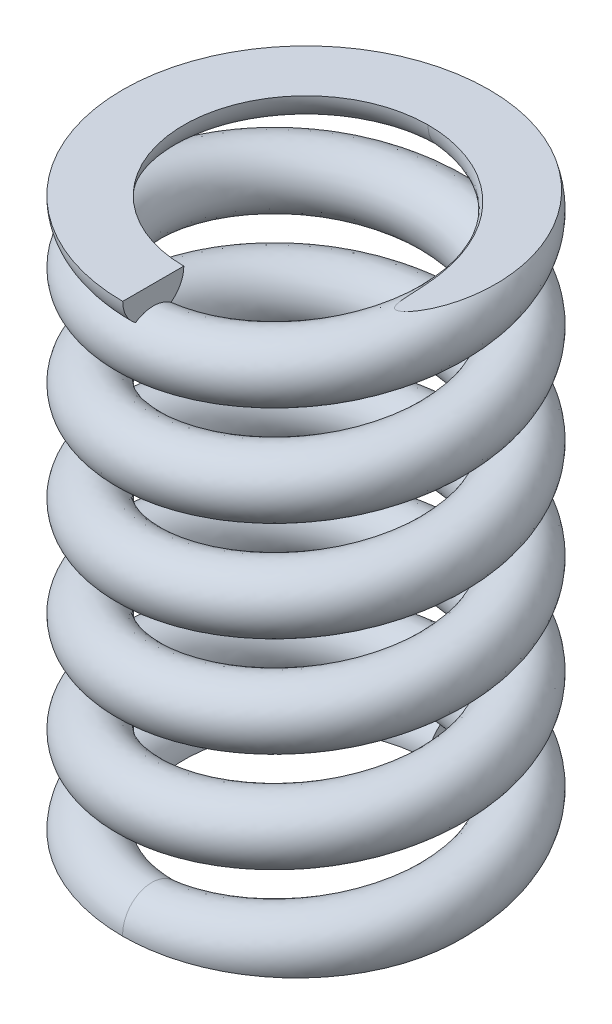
ISO-10303-21;
HEADER;
FILE_DESCRIPTION(('STEP AP214'),'2;1');
FILE_NAME('part.step','',(''),(''),'','','');
FILE_SCHEMA(('AUTOMOTIVE_DESIGN { 1 0 10303 214 1 1 1 1 }'));
ENDSEC;
DATA;
#1=APPLICATION_CONTEXT('core data for automotive mechanical design processes');
#2=APPLICATION_PROTOCOL_DEFINITION('international standard','automotive_design',2000,#1);
#3=PRODUCT_CONTEXT('',#1,'mechanical');
#4=PRODUCT('Part','Part','',(#3));
#5=PRODUCT_RELATED_PRODUCT_CATEGORY('part','',(#4));
#6=PRODUCT_DEFINITION_FORMATION('','',#4);
#7=PRODUCT_DEFINITION_CONTEXT('part definition',#1,'design');
#8=PRODUCT_DEFINITION('design','',#6,#7);
#9=PRODUCT_DEFINITION_SHAPE('','',#8);
#10=(LENGTH_UNIT() NAMED_UNIT(*) SI_UNIT(.MILLI.,.METRE.));
#11=(NAMED_UNIT(*) PLANE_ANGLE_UNIT() SI_UNIT($,.RADIAN.));
#12=(NAMED_UNIT(*) SI_UNIT($,.STERADIAN.) SOLID_ANGLE_UNIT());
#13=UNCERTAINTY_MEASURE_WITH_UNIT(LENGTH_MEASURE(1.E-05),#10,'distance_accuracy_value','');
#14=(GEOMETRIC_REPRESENTATION_CONTEXT(3) GLOBAL_UNCERTAINTY_ASSIGNED_CONTEXT((#13)) GLOBAL_UNIT_ASSIGNED_CONTEXT((#10,
#11,#12)) REPRESENTATION_CONTEXT('',''));
#15=CARTESIAN_POINT('',(0.,0.,0.));
#16=DIRECTION('',(0.,0.,1.));
#17=DIRECTION('',(1.,0.,0.));
#18=AXIS2_PLACEMENT_3D('',#15,#16,#17);
#19=CARTESIAN_POINT('',(0.,8.99998,0.));
#20=DIRECTION('',(0.,1.,0.));
#21=DIRECTION('',(0.,0.,1.));
#22=AXIS2_PLACEMENT_3D('',#19,#20,#21);
#23=PLANE('',#22);
#24=CARTESIAN_POINT('',(0.,8.99998,-3.));
#25=CARTESIAN_POINT('',(0.0808215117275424,8.99998,-3.00000928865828));
#26=CARTESIAN_POINT('',(0.161643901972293,8.99998,-2.996602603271));
#27=CARTESIAN_POINT('',(0.322714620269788,8.99998,-2.98299756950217));
#28=CARTESIAN_POINT('',(0.402962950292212,8.99998,-2.97279924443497));
#29=CARTESIAN_POINT('',(0.562233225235,8.99998,-2.94566434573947));
#30=CARTESIAN_POINT('',(0.641256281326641,8.99998,-2.92873429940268));
#31=CARTESIAN_POINT('',(0.797583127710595,8.99998,-2.88824228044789));
#32=CARTESIAN_POINT('',(0.874886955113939,8.99998,-2.86468045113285));
#33=CARTESIAN_POINT('',(1.02727663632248,8.99998,-2.81105719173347));
#34=CARTESIAN_POINT('',(1.10236066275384,8.99998,-2.78099056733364));
#35=CARTESIAN_POINT('',(1.24969713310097,8.99998,-2.71457581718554));
#36=CARTESIAN_POINT('',(1.32194959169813,8.99998,-2.67822772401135));
#37=CARTESIAN_POINT('',(1.46310137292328,8.99998,-2.59950129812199));
#38=CARTESIAN_POINT('',(1.5320003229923,8.99998,-2.55712229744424));
#39=CARTESIAN_POINT('',(1.66593618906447,8.99998,-2.46664321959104));
#40=CARTESIAN_POINT('',(1.73097303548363,8.99998,-2.41854303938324));
#41=CARTESIAN_POINT('',(1.85604233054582,8.99998,-2.31749404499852));
#42=CARTESIAN_POINT('',(1.9161199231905,8.99998,-2.2646010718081));
#43=CARTESIAN_POINT('',(2.03162724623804,8.99998,-2.15396334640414));
#44=CARTESIAN_POINT('',(2.08705705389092,8.99998,-2.0962186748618));
#45=CARTESIAN_POINT('',(2.19270407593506,8.99998,-1.97617249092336));
#46=CARTESIAN_POINT('',(2.24292351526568,8.99998,-1.91387294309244));
#47=CARTESIAN_POINT('',(2.33769246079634,8.99998,-1.78512916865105));
#48=CARTESIAN_POINT('',(2.38224221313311,8.99998,-1.7186851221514));
#49=CARTESIAN_POINT('',(2.50510378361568,8.99998,-1.5166084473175));
#50=CARTESIAN_POINT('',(2.5748907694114,8.99998,-1.37565366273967));
#51=CARTESIAN_POINT('',(2.68855633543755,8.99998000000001,-1.08339325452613));
#52=CARTESIAN_POINT('',(2.73240288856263,8.99998000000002,-0.932075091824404));
#53=CARTESIAN_POINT('',(2.77634488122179,8.99997999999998,-0.704795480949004));
#54=CARTESIAN_POINT('',(2.78732887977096,8.99997999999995,-0.63081118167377));
#55=CARTESIAN_POINT('',(2.80272240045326,8.99998000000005,-0.482119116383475));
#56=CARTESIAN_POINT('',(2.807130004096,8.99998000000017,-0.407411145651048));
#57=CARTESIAN_POINT('',(2.80917242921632,8.99997999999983,-0.258177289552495));
#58=CARTESIAN_POINT('',(2.8068332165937,8.99997999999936,-0.183651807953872));
#59=CARTESIAN_POINT('',(2.79816370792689,8.99998000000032,-0.0723130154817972));
#60=CARTESIAN_POINT('',(2.7944151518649,8.99998000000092,-0.0352831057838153));
#61=CARTESIAN_POINT('',(2.78517836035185,8.99997999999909,0.0385568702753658));
#62=CARTESIAN_POINT('',(2.77969050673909,8.99997999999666,0.0753669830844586));
#63=CARTESIAN_POINT('',(2.76814670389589,8.99997999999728,0.140752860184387));
#64=CARTESIAN_POINT('',(2.76246744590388,8.99997999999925,0.169395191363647));
#65=CARTESIAN_POINT('',(2.74988540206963,8.99998000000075,0.226404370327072));
#66=CARTESIAN_POINT('',(2.74298279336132,8.99998000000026,0.254771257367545));
#67=CARTESIAN_POINT('',(2.72033493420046,8.99997999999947,0.339485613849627));
#68=CARTESIAN_POINT('',(2.702669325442,8.99997999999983,0.395332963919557));
#69=CARTESIAN_POINT('',(2.66156842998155,8.99998000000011,0.505383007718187));
#70=CARTESIAN_POINT('',(2.63809292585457,8.99998000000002,0.5595711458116));
#71=CARTESIAN_POINT('',(2.59776854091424,8.99997999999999,0.638074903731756));
#72=CARTESIAN_POINT('',(2.58351063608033,8.99998,0.663728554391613));
#73=CARTESIAN_POINT('',(2.55297117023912,8.99998,0.713791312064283));
#74=CARTESIAN_POINT('',(2.5366924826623,8.99997999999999,0.73820211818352));
#75=CARTESIAN_POINT('',(2.5118918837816,8.99998000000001,0.77118885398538));
#76=CARTESIAN_POINT('',(2.50447268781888,8.99998000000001,0.780595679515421));
#77=CARTESIAN_POINT('',(2.48908741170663,8.99997999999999,0.798991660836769));
#78=CARTESIAN_POINT('',(2.4811201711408,8.99997999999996,0.807979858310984));
#79=CARTESIAN_POINT('',(2.46378556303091,8.99998000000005,0.826140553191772));
#80=CARTESIAN_POINT('',(2.45435678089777,8.99998000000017,0.835254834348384));
#81=CARTESIAN_POINT('',(2.4345149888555,8.99997999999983,0.852321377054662));
#82=CARTESIAN_POINT('',(2.4241062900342,8.99997999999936,0.860278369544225));
#83=CARTESIAN_POINT('',(2.40497111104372,8.99997999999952,0.872148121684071));
#84=CARTESIAN_POINT('',(2.39656795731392,8.99997999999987,0.876571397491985));
#85=CARTESIAN_POINT('',(2.37871638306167,8.99998000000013,0.883351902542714));
#86=CARTESIAN_POINT('',(2.36925999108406,8.99998000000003,0.88569197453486));
#87=CARTESIAN_POINT('',(2.35341782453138,8.99997999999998,0.886005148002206));
#88=CARTESIAN_POINT('',(2.34709878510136,8.99998,0.885206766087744));
#89=CARTESIAN_POINT('',(2.33514185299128,8.99998000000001,0.881394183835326));
#90=CARTESIAN_POINT('',(2.32950567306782,8.99998,0.878374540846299));
#91=CARTESIAN_POINT('',(2.31798064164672,8.99998,0.869672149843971));
#92=CARTESIAN_POINT('',(2.3125150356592,8.99998,0.863464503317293));
#93=CARTESIAN_POINT('',(2.30366655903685,8.99998,0.850653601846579));
#94=CARTESIAN_POINT('',(2.30013957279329,8.99998,0.844137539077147));
#95=CARTESIAN_POINT('',(2.29396809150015,8.99998,0.830683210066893));
#96=CARTESIAN_POINT('',(2.29132667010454,8.99998,0.823743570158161));
#97=CARTESIAN_POINT('',(2.28451960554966,8.99997999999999,0.80327877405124));
#98=CARTESIAN_POINT('',(2.28115083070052,8.99998,0.78950116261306));
#99=CARTESIAN_POINT('',(2.27554661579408,8.99998,0.761751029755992));
#100=CARTESIAN_POINT('',(2.2733111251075,8.99998,0.747778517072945));
#101=CARTESIAN_POINT('',(2.26949531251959,8.99998,0.719650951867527));
#102=CARTESIAN_POINT('',(2.26791943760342,8.99998,0.705495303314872));
#103=CARTESIAN_POINT('',(2.26517698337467,8.99998,0.677155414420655));
#104=CARTESIAN_POINT('',(2.26401017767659,8.99998,0.66297119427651));
#105=CARTESIAN_POINT('',(2.26090255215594,8.99998,0.620836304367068));
#106=CARTESIAN_POINT('',(2.25930694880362,8.99998,0.592861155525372));
#107=CARTESIAN_POINT('',(2.25636303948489,8.99998,0.536897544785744));
#108=CARTESIAN_POINT('',(2.25501476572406,8.99998,0.508909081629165));
#109=CARTESIAN_POINT('',(2.25079833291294,8.99998,0.424935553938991));
#110=CARTESIAN_POINT('',(2.24775915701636,8.99998000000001,0.368956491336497));
#111=CARTESIAN_POINT('',(2.23980839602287,8.99997999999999,0.257445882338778));
#112=CARTESIAN_POINT('',(2.23490781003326,8.99997999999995,0.201913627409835));
#113=CARTESIAN_POINT('',(2.22569489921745,8.99998000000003,0.118819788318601));
#114=CARTESIAN_POINT('',(2.2223133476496,8.99998000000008,0.0911543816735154));
#115=CARTESIAN_POINT('',(2.21485176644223,8.99997999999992,0.035918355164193));
#116=CARTESIAN_POINT('',(2.21077174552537,8.99997999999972,0.00834773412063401));
#117=CARTESIAN_POINT('',(2.19459077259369,8.99997999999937,-0.0904307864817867));
#118=CARTESIAN_POINT('',(2.18005800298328,8.99997999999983,-0.161260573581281));
#119=CARTESIAN_POINT('',(2.14520076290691,8.99998000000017,-0.301485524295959));
#120=CARTESIAN_POINT('',(2.12487547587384,8.99998000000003,-0.370880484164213));
#121=CARTESIAN_POINT('',(2.07825333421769,8.99997999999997,-0.507950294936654));
#122=CARTESIAN_POINT('',(2.05193321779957,8.99998000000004,-0.575617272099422));
#123=CARTESIAN_POINT('',(1.99342116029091,8.99997999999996,-0.708365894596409));
#124=CARTESIAN_POINT('',(1.96122929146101,8.99997999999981,-0.773447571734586));
#125=CARTESIAN_POINT('',(1.89145240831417,8.9999799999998,-0.899809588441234));
#126=CARTESIAN_POINT('',(1.85392445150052,8.99997999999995,-0.961121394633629));
#127=CARTESIAN_POINT('',(1.77344050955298,8.99998000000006,-1.08008315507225));
#128=CARTESIAN_POINT('',(1.73048409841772,8.99998000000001,-1.13773282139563));
#129=CARTESIAN_POINT('',(1.63948706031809,8.99997999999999,-1.24870843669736));
#130=CARTESIAN_POINT('',(1.59145550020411,8.99998,-1.30204180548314));
#131=CARTESIAN_POINT('',(1.49062957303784,8.99998,-1.4039590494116));
#132=CARTESIAN_POINT('',(1.43783625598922,8.99998,-1.45254396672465));
#133=CARTESIAN_POINT('',(1.28254376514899,8.99997999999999,-1.58175439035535));
#134=CARTESIAN_POINT('',(1.17469202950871,8.99998,-1.65610363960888));
#135=CARTESIAN_POINT('',(0.947483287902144,8.99998,-1.78431253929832));
#136=CARTESIAN_POINT('',(0.828122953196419,8.99998000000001,-1.83816623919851));
#137=CARTESIAN_POINT('',(0.591778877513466,8.99998,-1.92009368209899));
#138=CARTESIAN_POINT('',(0.475408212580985,8.99998,-1.9499245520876));
#139=CARTESIAN_POINT('',(0.298443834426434,8.99998,-1.97989078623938));
#140=CARTESIAN_POINT('',(0.239021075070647,8.99998,-1.98741625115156));
#141=CARTESIAN_POINT('',(0.119742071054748,8.99998,-1.99747106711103));
#142=CARTESIAN_POINT('',(0.0598857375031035,8.99998,-1.99999936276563));
#143=CARTESIAN_POINT('',(0.,8.99998,-2.));
#144=B_SPLINE_CURVE_WITH_KNOTS('',3,(#24,#25,#26,#27,#28,#29,#30,#31,#32,#33,#34,#35,#36,#37,
#38,#39,#40,#41,#42,#43,#44,#45,#46,#47,#48,#49,#50,#51,#52,#53,#54,#55,#56,#57,#58,#59,#60,#61,
#62,#63,#64,#65,#66,#67,#68,#69,#70,#71,#72,#73,#74,#75,#76,#77,#78,#79,#80,#81,#82,#83,#84,#85,
#86,#87,#88,#89,#90,#91,#92,#93,#94,#95,#96,#97,#98,#99,#100,#101,#102,#103,#104,#105,#106,#107,
#108,#109,#110,#111,#112,#113,#114,#115,#116,#117,#118,#119,#120,#121,#122,#123,#124,#125,#126,
#127,#128,#129,#130,#131,#132,#133,#134,#135,#136,#137,#138,#139,#140,#141,#142,#143),
.UNSPECIFIED.,.F.,.F.,(4,2,2,2,2,2,2,2,2,2,2,2,2,2,2,2,2,2,2,2,2,2,2,2,2,2,2,2,2,2,2,2,2,2,2,2,
2,2,2,2,2,2,2,2,2,2,2,2,2,2,2,2,2,2,2,2,2,2,2,4),(0.,0.242394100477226,0.484787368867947,
0.726946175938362,0.969099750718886,1.21144741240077,1.45379381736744,1.69616708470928,
1.93854471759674,2.17839281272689,2.4182369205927,2.65797818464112,2.8977090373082,
3.36702179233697,3.8369127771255,4.06105754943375,4.28526769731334,4.50861609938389,
4.62024108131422,4.73184157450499,4.81941464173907,4.90697503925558,5.08244108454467,
5.25915749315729,5.34714537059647,5.43500953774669,5.47093730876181,5.50694364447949,
5.54624032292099,5.58537154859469,5.61375351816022,5.6423671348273,5.66110449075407,
5.67988791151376,5.70425684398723,5.72641161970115,5.74864251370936,5.79108013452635,
5.83351585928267,5.87623323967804,5.91892694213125,6.00298082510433,6.0870456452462,
6.25521774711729,6.42241119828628,6.50601733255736,6.58962242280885,6.80627360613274,
7.02295534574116,7.24049265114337,7.45802727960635,7.67338991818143,7.88876946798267,
8.10377054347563,8.31872432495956,8.70940207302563,9.10019316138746,9.45881744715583,
9.63832650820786,9.81787347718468),.UNSPECIFIED.);
#145=CARTESIAN_POINT('',(0.,8.99998,-3.));
#146=VERTEX_POINT('',#145);
#147=CARTESIAN_POINT('',(0.,8.99998,-2.));
#148=VERTEX_POINT('',#147);
#149=EDGE_CURVE('E132',#146,#148,#144,.T.);
#150=ORIENTED_EDGE('',*,*,#149,.F.);
#151=CARTESIAN_POINT('',(0.,8.99998,0.));
#152=DIRECTION('',(0.,1.,0.));
#153=DIRECTION('',(0.,0.,1.));
#154=AXIS2_PLACEMENT_3D('',#151,#152,#153);
#155=CIRCLE('',#154,3.);
#156=CARTESIAN_POINT('',(0.,8.99998,3.));
#157=VERTEX_POINT('',#156);
#158=EDGE_CURVE('E129',#157,#146,#155,.F.);
#159=ORIENTED_EDGE('',*,*,#158,.F.);
#160=DIRECTION('',(0.,0.,-1.));
#161=VECTOR('',#160,1.);
#162=CARTESIAN_POINT('',(0.,8.99998,2.5));
#163=LINE('',#162,#161);
#164=CARTESIAN_POINT('',(0.,8.99998,2.));
#165=VERTEX_POINT('',#164);
#166=EDGE_CURVE('E12',#157,#165,#163,.T.);
#167=ORIENTED_EDGE('',*,*,#166,.T.);
#168=CARTESIAN_POINT('',(0.,8.99998,0.));
#169=DIRECTION('',(0.,-1.,0.));
#170=DIRECTION('',(0.,0.,-1.));
#171=AXIS2_PLACEMENT_3D('',#168,#169,#170);
#172=CIRCLE('',#171,2.);
#173=EDGE_CURVE('E123',#148,#165,#172,.F.);
#174=ORIENTED_EDGE('',*,*,#173,.F.);
#175=EDGE_LOOP('',(#150,#159,#167,#174));
#176=FACE_BOUND('',#175,.T.);
#177=ADVANCED_FACE('F44',(#176),#23,.T.);
#178=CARTESIAN_POINT('',(-0.0518066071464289,0.497308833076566,2.5));
#179=CARTESIAN_POINT('',(0.983727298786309,0.599581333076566,2.52145899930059));
#180=CARTESIAN_POINT('',(1.73113414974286,0.701853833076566,1.80439975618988));
#181=CARTESIAN_POINT('',(2.47854100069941,0.804126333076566,1.08734051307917));
#182=CARTESIAN_POINT('',(2.5,0.906398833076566,0.051806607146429));
#183=CARTESIAN_POINT('',(2.52145899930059,1.00867133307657,-0.983727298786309));
#184=CARTESIAN_POINT('',(1.80439975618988,1.11094383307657,-1.73113414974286));
#185=CARTESIAN_POINT('',(1.08734051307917,1.21321633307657,-2.47854100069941));
#186=CARTESIAN_POINT('',(0.0518066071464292,1.31548883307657,-2.5));
#187=CARTESIAN_POINT('',(-0.983727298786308,1.41776133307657,-2.52145899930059));
#188=CARTESIAN_POINT('',(-1.73113414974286,1.52003383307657,-1.80439975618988));
#189=CARTESIAN_POINT('',(-2.47854100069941,1.62230633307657,-1.08734051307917));
#190=CARTESIAN_POINT('',(-2.5,1.72457883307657,-0.0518066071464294));
#191=CARTESIAN_POINT('',(-2.52145899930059,1.82685133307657,0.983727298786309));
#192=CARTESIAN_POINT('',(-1.80439975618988,1.92912383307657,1.73113414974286));
#193=CARTESIAN_POINT('',(-1.08734051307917,2.03139633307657,2.47854100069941));
#194=CARTESIAN_POINT('',(-0.0518066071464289,2.13366883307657,2.5));
#195=CARTESIAN_POINT('',(0.983727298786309,2.23594133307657,2.52145899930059));
#196=CARTESIAN_POINT('',(1.73113414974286,2.33821383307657,1.80439975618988));
#197=CARTESIAN_POINT('',(2.47854100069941,2.44048633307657,1.08734051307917));
#198=CARTESIAN_POINT('',(2.5,2.54275883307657,0.051806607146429));
#199=CARTESIAN_POINT('',(2.52145899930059,2.64503133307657,-0.983727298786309));
#200=CARTESIAN_POINT('',(1.80439975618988,2.74730383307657,-1.73113414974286));
#201=CARTESIAN_POINT('',(1.08734051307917,2.84957633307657,-2.47854100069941));
#202=CARTESIAN_POINT('',(0.0518066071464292,2.95184883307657,-2.5));
#203=CARTESIAN_POINT('',(-0.983727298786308,3.05412133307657,-2.52145899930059));
#204=CARTESIAN_POINT('',(-1.73113414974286,3.15639383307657,-1.80439975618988));
#205=CARTESIAN_POINT('',(-2.47854100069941,3.25866633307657,-1.08734051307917));
#206=CARTESIAN_POINT('',(-2.5,3.36093883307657,-0.0518066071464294));
#207=CARTESIAN_POINT('',(-2.52145899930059,3.46321133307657,0.983727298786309));
#208=CARTESIAN_POINT('',(-1.80439975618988,3.56548383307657,1.73113414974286));
#209=CARTESIAN_POINT('',(-1.08734051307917,3.66775633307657,2.47854100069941));
#210=CARTESIAN_POINT('',(-0.0518066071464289,3.77002883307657,2.5));
#211=CARTESIAN_POINT('',(0.983727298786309,3.87230133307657,2.52145899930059));
#212=CARTESIAN_POINT('',(1.73113414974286,3.97457383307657,1.80439975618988));
#213=CARTESIAN_POINT('',(2.47854100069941,4.07684633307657,1.08734051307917));
#214=CARTESIAN_POINT('',(2.5,4.17911883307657,0.051806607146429));
#215=CARTESIAN_POINT('',(2.52145899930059,4.28139133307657,-0.983727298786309));
#216=CARTESIAN_POINT('',(1.80439975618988,4.38366383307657,-1.73113414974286));
#217=CARTESIAN_POINT('',(1.08734051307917,4.48593633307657,-2.47854100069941));
#218=CARTESIAN_POINT('',(0.0518066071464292,4.58820883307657,-2.5));
#219=CARTESIAN_POINT('',(-0.983727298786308,4.69048133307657,-2.52145899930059));
#220=CARTESIAN_POINT('',(-1.73113414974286,4.79275383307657,-1.80439975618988));
#221=CARTESIAN_POINT('',(-2.47854100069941,4.89502633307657,-1.08734051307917));
#222=CARTESIAN_POINT('',(-2.5,4.99729883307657,-0.0518066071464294));
#223=CARTESIAN_POINT('',(-2.52145899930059,5.09957133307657,0.983727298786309));
#224=CARTESIAN_POINT('',(-1.80439975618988,5.20184383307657,1.73113414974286));
#225=CARTESIAN_POINT('',(-1.08734051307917,5.30411633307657,2.47854100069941));
#226=CARTESIAN_POINT('',(-0.0518066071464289,5.40638883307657,2.5));
#227=CARTESIAN_POINT('',(0.983727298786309,5.50866133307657,2.52145899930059));
#228=CARTESIAN_POINT('',(1.73113414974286,5.61093383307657,1.80439975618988));
#229=CARTESIAN_POINT('',(2.47854100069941,5.71320633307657,1.08734051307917));
#230=CARTESIAN_POINT('',(2.5,5.81547883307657,0.051806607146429));
#231=CARTESIAN_POINT('',(2.52145899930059,5.91775133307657,-0.983727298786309));
#232=CARTESIAN_POINT('',(1.80439975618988,6.02002383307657,-1.73113414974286));
#233=CARTESIAN_POINT('',(1.08734051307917,6.12229633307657,-2.47854100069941));
#234=CARTESIAN_POINT('',(0.0518066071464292,6.22456883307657,-2.5));
#235=CARTESIAN_POINT('',(-0.983727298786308,6.32684133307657,-2.52145899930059));
#236=CARTESIAN_POINT('',(-1.73113414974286,6.42911383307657,-1.80439975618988));
#237=CARTESIAN_POINT('',(-2.47854100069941,6.53138633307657,-1.08734051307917));
#238=CARTESIAN_POINT('',(-2.5,6.63365883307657,-0.0518066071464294));
#239=CARTESIAN_POINT('',(-2.52145899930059,6.73593133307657,0.983727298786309));
#240=CARTESIAN_POINT('',(-1.80439975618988,6.83820383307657,1.73113414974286));
#241=CARTESIAN_POINT('',(-1.08734051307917,6.94047633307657,2.47854100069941));
#242=CARTESIAN_POINT('',(-0.0518066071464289,7.04274883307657,2.5));
#243=CARTESIAN_POINT('',(0.983727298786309,7.14502133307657,2.52145899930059));
#244=CARTESIAN_POINT('',(1.73113414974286,7.24729383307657,1.80439975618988));
#245=CARTESIAN_POINT('',(2.47854100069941,7.34956633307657,1.08734051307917));
#246=CARTESIAN_POINT('',(2.5,7.45183883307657,0.051806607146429));
#247=CARTESIAN_POINT('',(2.52145899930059,7.55411133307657,-0.983727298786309));
#248=CARTESIAN_POINT('',(1.80439975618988,7.65638383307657,-1.73113414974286));
#249=CARTESIAN_POINT('',(1.08734051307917,7.75865633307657,-2.47854100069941));
#250=CARTESIAN_POINT('',(0.0518066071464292,7.86092883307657,-2.5));
#251=CARTESIAN_POINT('',(-0.983727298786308,7.96320133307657,-2.52145899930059));
#252=CARTESIAN_POINT('',(-1.73113414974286,8.06547383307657,-1.80439975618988));
#253=CARTESIAN_POINT('',(-2.47854100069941,8.16774633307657,-1.08734051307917));
#254=CARTESIAN_POINT('',(-2.5,8.27001883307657,-0.0518066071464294));
#255=CARTESIAN_POINT('',(-2.52145899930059,8.37229133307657,0.983727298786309));
#256=CARTESIAN_POINT('',(-1.80439975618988,8.47456383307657,1.73113414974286));
#257=CARTESIAN_POINT('',(-1.08734051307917,8.57683633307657,2.47854100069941));
#258=CARTESIAN_POINT('',(-0.0518066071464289,8.67910883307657,2.5));
#259=CARTESIAN_POINT('',(0.983727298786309,8.78138133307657,2.52145899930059));
#260=CARTESIAN_POINT('',(1.73113414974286,8.88365383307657,1.80439975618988));
#261=CARTESIAN_POINT('',(2.47854100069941,8.98592633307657,1.08734051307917));
#262=CARTESIAN_POINT('',(2.5,9.08819883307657,0.051806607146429));
#263=CARTESIAN_POINT('',(2.52145899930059,9.19047133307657,-0.983727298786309));
#264=CARTESIAN_POINT('',(1.80439975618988,9.29274383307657,-1.73113414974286));
#265=CARTESIAN_POINT('',(1.08734051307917,9.39501633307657,-2.47854100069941));
#266=CARTESIAN_POINT('',(0.0518066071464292,9.49728883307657,-2.5));
#267=CARTESIAN_POINT('',(-0.0518066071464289,0.497308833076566,3.5));
#268=CARTESIAN_POINT('',(1.3979408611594,0.599581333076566,3.52145899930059));
#269=CARTESIAN_POINT('',(2.43824093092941,0.701853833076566,2.51150653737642));
#270=CARTESIAN_POINT('',(3.47854100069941,0.804126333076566,1.50155407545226));
#271=CARTESIAN_POINT('',(3.5,0.906398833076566,0.0518066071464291));
#272=CARTESIAN_POINT('',(3.52145899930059,1.00867133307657,-1.3979408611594));
#273=CARTESIAN_POINT('',(2.51150653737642,1.11094383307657,-2.43824093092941));
#274=CARTESIAN_POINT('',(1.50155407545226,1.21321633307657,-3.47854100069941));
#275=CARTESIAN_POINT('',(0.0518066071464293,1.31548883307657,-3.5));
#276=CARTESIAN_POINT('',(-1.3979408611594,1.41776133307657,-3.52145899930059));
#277=CARTESIAN_POINT('',(-2.43824093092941,1.52003383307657,-2.51150653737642));
#278=CARTESIAN_POINT('',(-3.47854100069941,1.62230633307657,-1.50155407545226));
#279=CARTESIAN_POINT('',(-3.5,1.72457883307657,-0.0518066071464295));
#280=CARTESIAN_POINT('',(-3.52145899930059,1.82685133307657,1.3979408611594));
#281=CARTESIAN_POINT('',(-2.51150653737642,1.92912383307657,2.43824093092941));
#282=CARTESIAN_POINT('',(-1.50155407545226,2.03139633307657,3.47854100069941));
#283=CARTESIAN_POINT('',(-0.0518066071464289,2.13366883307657,3.5));
#284=CARTESIAN_POINT('',(1.3979408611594,2.23594133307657,3.52145899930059));
#285=CARTESIAN_POINT('',(2.43824093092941,2.33821383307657,2.51150653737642));
#286=CARTESIAN_POINT('',(3.47854100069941,2.44048633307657,1.50155407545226));
#287=CARTESIAN_POINT('',(3.5,2.54275883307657,0.0518066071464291));
#288=CARTESIAN_POINT('',(3.52145899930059,2.64503133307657,-1.3979408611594));
#289=CARTESIAN_POINT('',(2.51150653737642,2.74730383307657,-2.43824093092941));
#290=CARTESIAN_POINT('',(1.50155407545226,2.84957633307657,-3.47854100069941));
#291=CARTESIAN_POINT('',(0.0518066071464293,2.95184883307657,-3.5));
#292=CARTESIAN_POINT('',(-1.3979408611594,3.05412133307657,-3.52145899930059));
#293=CARTESIAN_POINT('',(-2.43824093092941,3.15639383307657,-2.51150653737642));
#294=CARTESIAN_POINT('',(-3.47854100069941,3.25866633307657,-1.50155407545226));
#295=CARTESIAN_POINT('',(-3.5,3.36093883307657,-0.0518066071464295));
#296=CARTESIAN_POINT('',(-3.52145899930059,3.46321133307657,1.3979408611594));
#297=CARTESIAN_POINT('',(-2.51150653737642,3.56548383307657,2.43824093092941));
#298=CARTESIAN_POINT('',(-1.50155407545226,3.66775633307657,3.47854100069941));
#299=CARTESIAN_POINT('',(-0.0518066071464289,3.77002883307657,3.5));
#300=CARTESIAN_POINT('',(1.3979408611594,3.87230133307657,3.52145899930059));
#301=CARTESIAN_POINT('',(2.43824093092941,3.97457383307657,2.51150653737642));
#302=CARTESIAN_POINT('',(3.47854100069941,4.07684633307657,1.50155407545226));
#303=CARTESIAN_POINT('',(3.5,4.17911883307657,0.0518066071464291));
#304=CARTESIAN_POINT('',(3.52145899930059,4.28139133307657,-1.3979408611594));
#305=CARTESIAN_POINT('',(2.51150653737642,4.38366383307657,-2.43824093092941));
#306=CARTESIAN_POINT('',(1.50155407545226,4.48593633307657,-3.47854100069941));
#307=CARTESIAN_POINT('',(0.0518066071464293,4.58820883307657,-3.5));
#308=CARTESIAN_POINT('',(-1.3979408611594,4.69048133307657,-3.52145899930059));
#309=CARTESIAN_POINT('',(-2.43824093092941,4.79275383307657,-2.51150653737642));
#310=CARTESIAN_POINT('',(-3.47854100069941,4.89502633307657,-1.50155407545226));
#311=CARTESIAN_POINT('',(-3.5,4.99729883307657,-0.0518066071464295));
#312=CARTESIAN_POINT('',(-3.52145899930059,5.09957133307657,1.3979408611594));
#313=CARTESIAN_POINT('',(-2.51150653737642,5.20184383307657,2.43824093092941));
#314=CARTESIAN_POINT('',(-1.50155407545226,5.30411633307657,3.47854100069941));
#315=CARTESIAN_POINT('',(-0.0518066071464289,5.40638883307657,3.5));
#316=CARTESIAN_POINT('',(1.3979408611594,5.50866133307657,3.52145899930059));
#317=CARTESIAN_POINT('',(2.43824093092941,5.61093383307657,2.51150653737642));
#318=CARTESIAN_POINT('',(3.47854100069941,5.71320633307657,1.50155407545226));
#319=CARTESIAN_POINT('',(3.5,5.81547883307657,0.0518066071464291));
#320=CARTESIAN_POINT('',(3.52145899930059,5.91775133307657,-1.3979408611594));
#321=CARTESIAN_POINT('',(2.51150653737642,6.02002383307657,-2.43824093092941));
#322=CARTESIAN_POINT('',(1.50155407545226,6.12229633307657,-3.47854100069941));
#323=CARTESIAN_POINT('',(0.0518066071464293,6.22456883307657,-3.5));
#324=CARTESIAN_POINT('',(-1.3979408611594,6.32684133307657,-3.52145899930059));
#325=CARTESIAN_POINT('',(-2.43824093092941,6.42911383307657,-2.51150653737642));
#326=CARTESIAN_POINT('',(-3.47854100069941,6.53138633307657,-1.50155407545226));
#327=CARTESIAN_POINT('',(-3.5,6.63365883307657,-0.0518066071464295));
#328=CARTESIAN_POINT('',(-3.52145899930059,6.73593133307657,1.3979408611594));
#329=CARTESIAN_POINT('',(-2.51150653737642,6.83820383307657,2.43824093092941));
#330=CARTESIAN_POINT('',(-1.50155407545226,6.94047633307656,3.47854100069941));
#331=CARTESIAN_POINT('',(-0.0518066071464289,7.04274883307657,3.5));
#332=CARTESIAN_POINT('',(1.3979408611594,7.14502133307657,3.52145899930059));
#333=CARTESIAN_POINT('',(2.43824093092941,7.24729383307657,2.51150653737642));
#334=CARTESIAN_POINT('',(3.47854100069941,7.34956633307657,1.50155407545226));
#335=CARTESIAN_POINT('',(3.5,7.45183883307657,0.0518066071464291));
#336=CARTESIAN_POINT('',(3.52145899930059,7.55411133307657,-1.3979408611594));
#337=CARTESIAN_POINT('',(2.51150653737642,7.65638383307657,-2.43824093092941));
#338=CARTESIAN_POINT('',(1.50155407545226,7.75865633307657,-3.47854100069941));
#339=CARTESIAN_POINT('',(0.0518066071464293,7.86092883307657,-3.5));
#340=CARTESIAN_POINT('',(-1.3979408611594,7.96320133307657,-3.52145899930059));
#341=CARTESIAN_POINT('',(-2.43824093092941,8.06547383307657,-2.51150653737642));
#342=CARTESIAN_POINT('',(-3.47854100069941,8.16774633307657,-1.50155407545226));
#343=CARTESIAN_POINT('',(-3.5,8.27001883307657,-0.0518066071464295));
#344=CARTESIAN_POINT('',(-3.52145899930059,8.37229133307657,1.3979408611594));
#345=CARTESIAN_POINT('',(-2.51150653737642,8.47456383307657,2.43824093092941));
#346=CARTESIAN_POINT('',(-1.50155407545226,8.57683633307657,3.47854100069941));
#347=CARTESIAN_POINT('',(-0.0518066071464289,8.67910883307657,3.5));
#348=CARTESIAN_POINT('',(1.3979408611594,8.78138133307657,3.52145899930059));
#349=CARTESIAN_POINT('',(2.43824093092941,8.88365383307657,2.51150653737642));
#350=CARTESIAN_POINT('',(3.47854100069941,8.98592633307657,1.50155407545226));
#351=CARTESIAN_POINT('',(3.5,9.08819883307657,0.0518066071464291));
#352=CARTESIAN_POINT('',(3.52145899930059,9.19047133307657,-1.3979408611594));
#353=CARTESIAN_POINT('',(2.51150653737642,9.29274383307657,-2.43824093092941));
#354=CARTESIAN_POINT('',(1.50155407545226,9.39501633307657,-3.47854100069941));
#355=CARTESIAN_POINT('',(0.0518066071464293,9.49728883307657,-3.5));
#356=CARTESIAN_POINT('',(0.0518066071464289,-0.497308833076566,3.5));
#357=CARTESIAN_POINT('',(1.50155407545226,-0.395036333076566,3.47854100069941));
#358=CARTESIAN_POINT('',(2.51150653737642,-0.292763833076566,2.43824093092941));
#359=CARTESIAN_POINT('',(3.52145899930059,-0.190491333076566,1.3979408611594));
#360=CARTESIAN_POINT('',(3.5,-0.0882188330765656,-0.0518066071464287));
#361=CARTESIAN_POINT('',(3.47854100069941,0.0140536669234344,-1.50155407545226));
#362=CARTESIAN_POINT('',(2.43824093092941,0.116326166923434,-2.51150653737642));
#363=CARTESIAN_POINT('',(1.3979408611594,0.218598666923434,-3.52145899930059));
#364=CARTESIAN_POINT('',(-0.0518066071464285,0.320871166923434,-3.5));
#365=CARTESIAN_POINT('',(-1.50155407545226,0.423143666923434,-3.47854100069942));
#366=CARTESIAN_POINT('',(-2.51150653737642,0.525416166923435,-2.43824093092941));
#367=CARTESIAN_POINT('',(-3.52145899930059,0.627688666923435,-1.39794086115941));
#368=CARTESIAN_POINT('',(-3.5,0.729961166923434,0.0518066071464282));
#369=CARTESIAN_POINT('',(-3.47854100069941,0.832233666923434,1.50155407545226));
#370=CARTESIAN_POINT('',(-2.43824093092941,0.934506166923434,2.51150653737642));
#371=CARTESIAN_POINT('',(-1.39794086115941,1.03677866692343,3.52145899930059));
#372=CARTESIAN_POINT('',(0.0518066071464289,1.13905116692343,3.5));
#373=CARTESIAN_POINT('',(1.50155407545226,1.24132366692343,3.47854100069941));
#374=CARTESIAN_POINT('',(2.51150653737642,1.34359616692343,2.43824093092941));
#375=CARTESIAN_POINT('',(3.52145899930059,1.44586866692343,1.3979408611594));
#376=CARTESIAN_POINT('',(3.5,1.54814116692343,-0.0518066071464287));
#377=CARTESIAN_POINT('',(3.47854100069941,1.65041366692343,-1.50155407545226));
#378=CARTESIAN_POINT('',(2.43824093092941,1.75268616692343,-2.51150653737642));
#379=CARTESIAN_POINT('',(1.3979408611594,1.85495866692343,-3.52145899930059));
#380=CARTESIAN_POINT('',(-0.0518066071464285,1.95723116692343,-3.5));
#381=CARTESIAN_POINT('',(-1.50155407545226,2.05950366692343,-3.47854100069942));
#382=CARTESIAN_POINT('',(-2.51150653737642,2.16177616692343,-2.43824093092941));
#383=CARTESIAN_POINT('',(-3.52145899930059,2.26404866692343,-1.39794086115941));
#384=CARTESIAN_POINT('',(-3.5,2.36632116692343,0.0518066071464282));
#385=CARTESIAN_POINT('',(-3.47854100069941,2.46859366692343,1.50155407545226));
#386=CARTESIAN_POINT('',(-2.43824093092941,2.57086616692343,2.51150653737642));
#387=CARTESIAN_POINT('',(-1.39794086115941,2.67313866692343,3.52145899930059));
#388=CARTESIAN_POINT('',(0.0518066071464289,2.77541116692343,3.5));
#389=CARTESIAN_POINT('',(1.50155407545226,2.87768366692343,3.47854100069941));
#390=CARTESIAN_POINT('',(2.51150653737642,2.97995616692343,2.43824093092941));
#391=CARTESIAN_POINT('',(3.52145899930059,3.08222866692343,1.3979408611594));
#392=CARTESIAN_POINT('',(3.5,3.18450116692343,-0.0518066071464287));
#393=CARTESIAN_POINT('',(3.47854100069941,3.28677366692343,-1.50155407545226));
#394=CARTESIAN_POINT('',(2.43824093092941,3.38904616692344,-2.51150653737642));
#395=CARTESIAN_POINT('',(1.3979408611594,3.49131866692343,-3.52145899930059));
#396=CARTESIAN_POINT('',(-0.0518066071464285,3.59359116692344,-3.5));
#397=CARTESIAN_POINT('',(-1.50155407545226,3.69586366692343,-3.47854100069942));
#398=CARTESIAN_POINT('',(-2.51150653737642,3.79813616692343,-2.43824093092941));
#399=CARTESIAN_POINT('',(-3.52145899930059,3.90040866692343,-1.39794086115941));
#400=CARTESIAN_POINT('',(-3.5,4.00268116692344,0.0518066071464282));
#401=CARTESIAN_POINT('',(-3.47854100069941,4.10495366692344,1.50155407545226));
#402=CARTESIAN_POINT('',(-2.43824093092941,4.20722616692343,2.51150653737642));
#403=CARTESIAN_POINT('',(-1.39794086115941,4.30949866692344,3.52145899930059));
#404=CARTESIAN_POINT('',(0.0518066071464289,4.41177116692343,3.5));
#405=CARTESIAN_POINT('',(1.50155407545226,4.51404366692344,3.47854100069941));
#406=CARTESIAN_POINT('',(2.51150653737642,4.61631616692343,2.43824093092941));
#407=CARTESIAN_POINT('',(3.52145899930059,4.71858866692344,1.3979408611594));
#408=CARTESIAN_POINT('',(3.5,4.82086116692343,-0.0518066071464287));
#409=CARTESIAN_POINT('',(3.47854100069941,4.92313366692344,-1.50155407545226));
#410=CARTESIAN_POINT('',(2.43824093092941,5.02540616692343,-2.51150653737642));
#411=CARTESIAN_POINT('',(1.3979408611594,5.12767866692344,-3.52145899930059));
#412=CARTESIAN_POINT('',(-0.0518066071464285,5.22995116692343,-3.5));
#413=CARTESIAN_POINT('',(-1.50155407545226,5.33222366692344,-3.47854100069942));
#414=CARTESIAN_POINT('',(-2.51150653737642,5.43449616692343,-2.43824093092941));
#415=CARTESIAN_POINT('',(-3.52145899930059,5.53676866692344,-1.39794086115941));
#416=CARTESIAN_POINT('',(-3.5,5.63904116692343,0.0518066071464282));
#417=CARTESIAN_POINT('',(-3.47854100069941,5.74131366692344,1.50155407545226));
#418=CARTESIAN_POINT('',(-2.43824093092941,5.84358616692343,2.51150653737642));
#419=CARTESIAN_POINT('',(-1.39794086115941,5.94585866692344,3.52145899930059));
#420=CARTESIAN_POINT('',(0.0518066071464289,6.04813116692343,3.5));
#421=CARTESIAN_POINT('',(1.50155407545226,6.15040366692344,3.47854100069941));
#422=CARTESIAN_POINT('',(2.51150653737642,6.25267616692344,2.43824093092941));
#423=CARTESIAN_POINT('',(3.52145899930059,6.35494866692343,1.3979408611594));
#424=CARTESIAN_POINT('',(3.5,6.45722116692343,-0.0518066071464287));
#425=CARTESIAN_POINT('',(3.47854100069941,6.55949366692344,-1.50155407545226));
#426=CARTESIAN_POINT('',(2.43824093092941,6.66176616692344,-2.51150653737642));
#427=CARTESIAN_POINT('',(1.3979408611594,6.76403866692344,-3.52145899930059));
#428=CARTESIAN_POINT('',(-0.0518066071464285,6.86631116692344,-3.5));
#429=CARTESIAN_POINT('',(-1.50155407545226,6.96858366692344,-3.47854100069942));
#430=CARTESIAN_POINT('',(-2.51150653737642,7.07085616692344,-2.43824093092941));
#431=CARTESIAN_POINT('',(-3.52145899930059,7.17312866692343,-1.39794086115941));
#432=CARTESIAN_POINT('',(-3.5,7.27540116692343,0.0518066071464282));
#433=CARTESIAN_POINT('',(-3.47854100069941,7.37767366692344,1.50155407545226));
#434=CARTESIAN_POINT('',(-2.43824093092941,7.47994616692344,2.51150653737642));
#435=CARTESIAN_POINT('',(-1.39794086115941,7.58221866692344,3.52145899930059));
#436=CARTESIAN_POINT('',(0.0518066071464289,7.68449116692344,3.5));
#437=CARTESIAN_POINT('',(1.50155407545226,7.78676366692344,3.47854100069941));
#438=CARTESIAN_POINT('',(2.51150653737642,7.88903616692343,2.43824093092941));
#439=CARTESIAN_POINT('',(3.52145899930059,7.99130866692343,1.3979408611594));
#440=CARTESIAN_POINT('',(3.5,8.09358116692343,-0.0518066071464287));
#441=CARTESIAN_POINT('',(3.47854100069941,8.19585366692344,-1.50155407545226));
#442=CARTESIAN_POINT('',(2.43824093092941,8.29812616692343,-2.51150653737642));
#443=CARTESIAN_POINT('',(1.3979408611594,8.40039866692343,-3.52145899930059));
#444=CARTESIAN_POINT('',(-0.0518066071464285,8.50267116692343,-3.5));
#445=CARTESIAN_POINT('',(0.0518066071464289,-0.497308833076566,2.5));
#446=CARTESIAN_POINT('',(1.08734051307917,-0.395036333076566,2.47854100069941));
#447=CARTESIAN_POINT('',(1.80439975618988,-0.292763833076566,1.73113414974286));
#448=CARTESIAN_POINT('',(2.52145899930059,-0.190491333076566,0.983727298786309));
#449=CARTESIAN_POINT('',(2.5,-0.0882188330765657,-0.0518066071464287));
#450=CARTESIAN_POINT('',(2.47854100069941,0.0140536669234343,-1.08734051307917));
#451=CARTESIAN_POINT('',(1.73113414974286,0.116326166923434,-1.80439975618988));
#452=CARTESIAN_POINT('',(0.983727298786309,0.218598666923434,-2.52145899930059));
#453=CARTESIAN_POINT('',(-0.0518066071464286,0.320871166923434,-2.5));
#454=CARTESIAN_POINT('',(-1.08734051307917,0.423143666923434,-2.47854100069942));
#455=CARTESIAN_POINT('',(-1.80439975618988,0.525416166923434,-1.73113414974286));
#456=CARTESIAN_POINT('',(-2.52145899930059,0.627688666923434,-0.98372729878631));
#457=CARTESIAN_POINT('',(-2.5,0.729961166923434,0.0518066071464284));
#458=CARTESIAN_POINT('',(-2.47854100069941,0.832233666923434,1.08734051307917));
#459=CARTESIAN_POINT('',(-1.73113414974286,0.934506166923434,1.80439975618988));
#460=CARTESIAN_POINT('',(-0.983727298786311,1.03677866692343,2.52145899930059));
#461=CARTESIAN_POINT('',(0.0518066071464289,1.13905116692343,2.5));
#462=CARTESIAN_POINT('',(1.08734051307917,1.24132366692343,2.47854100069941));
#463=CARTESIAN_POINT('',(1.80439975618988,1.34359616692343,1.73113414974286));
#464=CARTESIAN_POINT('',(2.52145899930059,1.44586866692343,0.983727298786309));
#465=CARTESIAN_POINT('',(2.5,1.54814116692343,-0.0518066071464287));
#466=CARTESIAN_POINT('',(2.47854100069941,1.65041366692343,-1.08734051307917));
#467=CARTESIAN_POINT('',(1.73113414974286,1.75268616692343,-1.80439975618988));
#468=CARTESIAN_POINT('',(0.983727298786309,1.85495866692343,-2.52145899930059));
#469=CARTESIAN_POINT('',(-0.0518066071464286,1.95723116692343,-2.5));
#470=CARTESIAN_POINT('',(-1.08734051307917,2.05950366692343,-2.47854100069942));
#471=CARTESIAN_POINT('',(-1.80439975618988,2.16177616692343,-1.73113414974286));
#472=CARTESIAN_POINT('',(-2.52145899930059,2.26404866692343,-0.98372729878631));
#473=CARTESIAN_POINT('',(-2.5,2.36632116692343,0.0518066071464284));
#474=CARTESIAN_POINT('',(-2.47854100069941,2.46859366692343,1.08734051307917));
#475=CARTESIAN_POINT('',(-1.73113414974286,2.57086616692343,1.80439975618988));
#476=CARTESIAN_POINT('',(-0.983727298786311,2.67313866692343,2.52145899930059));
#477=CARTESIAN_POINT('',(0.0518066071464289,2.77541116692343,2.5));
#478=CARTESIAN_POINT('',(1.08734051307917,2.87768366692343,2.47854100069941));
#479=CARTESIAN_POINT('',(1.80439975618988,2.97995616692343,1.73113414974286));
#480=CARTESIAN_POINT('',(2.52145899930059,3.08222866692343,0.983727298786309));
#481=CARTESIAN_POINT('',(2.5,3.18450116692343,-0.0518066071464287));
#482=CARTESIAN_POINT('',(2.47854100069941,3.28677366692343,-1.08734051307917));
#483=CARTESIAN_POINT('',(1.73113414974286,3.38904616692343,-1.80439975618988));
#484=CARTESIAN_POINT('',(0.983727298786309,3.49131866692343,-2.52145899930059));
#485=CARTESIAN_POINT('',(-0.0518066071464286,3.59359116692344,-2.5));
#486=CARTESIAN_POINT('',(-1.08734051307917,3.69586366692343,-2.47854100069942));
#487=CARTESIAN_POINT('',(-1.80439975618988,3.79813616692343,-1.73113414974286));
#488=CARTESIAN_POINT('',(-2.52145899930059,3.90040866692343,-0.98372729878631));
#489=CARTESIAN_POINT('',(-2.5,4.00268116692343,0.0518066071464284));
#490=CARTESIAN_POINT('',(-2.47854100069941,4.10495366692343,1.08734051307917));
#491=CARTESIAN_POINT('',(-1.73113414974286,4.20722616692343,1.80439975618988));
#492=CARTESIAN_POINT('',(-0.983727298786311,4.30949866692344,2.52145899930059));
#493=CARTESIAN_POINT('',(0.0518066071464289,4.41177116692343,2.5));
#494=CARTESIAN_POINT('',(1.08734051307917,4.51404366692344,2.47854100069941));
#495=CARTESIAN_POINT('',(1.80439975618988,4.61631616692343,1.73113414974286));
#496=CARTESIAN_POINT('',(2.52145899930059,4.71858866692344,0.983727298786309));
#497=CARTESIAN_POINT('',(2.5,4.82086116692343,-0.0518066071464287));
#498=CARTESIAN_POINT('',(2.47854100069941,4.92313366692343,-1.08734051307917));
#499=CARTESIAN_POINT('',(1.73113414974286,5.02540616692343,-1.80439975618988));
#500=CARTESIAN_POINT('',(0.983727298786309,5.12767866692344,-2.52145899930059));
#501=CARTESIAN_POINT('',(-0.0518066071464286,5.22995116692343,-2.5));
#502=CARTESIAN_POINT('',(-1.08734051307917,5.33222366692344,-2.47854100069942));
#503=CARTESIAN_POINT('',(-1.80439975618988,5.43449616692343,-1.73113414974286));
#504=CARTESIAN_POINT('',(-2.52145899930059,5.53676866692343,-0.98372729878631));
#505=CARTESIAN_POINT('',(-2.5,5.63904116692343,0.0518066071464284));
#506=CARTESIAN_POINT('',(-2.47854100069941,5.74131366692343,1.08734051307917));
#507=CARTESIAN_POINT('',(-1.73113414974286,5.84358616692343,1.80439975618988));
#508=CARTESIAN_POINT('',(-0.983727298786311,5.94585866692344,2.52145899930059));
#509=CARTESIAN_POINT('',(0.0518066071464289,6.04813116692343,2.5));
#510=CARTESIAN_POINT('',(1.08734051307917,6.15040366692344,2.47854100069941));
#511=CARTESIAN_POINT('',(1.80439975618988,6.25267616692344,1.73113414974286));
#512=CARTESIAN_POINT('',(2.52145899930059,6.35494866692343,0.983727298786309));
#513=CARTESIAN_POINT('',(2.5,6.45722116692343,-0.0518066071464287));
#514=CARTESIAN_POINT('',(2.47854100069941,6.55949366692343,-1.08734051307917));
#515=CARTESIAN_POINT('',(1.73113414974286,6.66176616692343,-1.80439975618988));
#516=CARTESIAN_POINT('',(0.983727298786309,6.76403866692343,-2.52145899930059));
#517=CARTESIAN_POINT('',(-0.0518066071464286,6.86631116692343,-2.5));
#518=CARTESIAN_POINT('',(-1.08734051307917,6.96858366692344,-2.47854100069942));
#519=CARTESIAN_POINT('',(-1.80439975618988,7.07085616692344,-1.73113414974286));
#520=CARTESIAN_POINT('',(-2.52145899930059,7.17312866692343,-0.98372729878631));
#521=CARTESIAN_POINT('',(-2.5,7.27540116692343,0.0518066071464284));
#522=CARTESIAN_POINT('',(-2.47854100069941,7.37767366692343,1.08734051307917));
#523=CARTESIAN_POINT('',(-1.73113414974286,7.47994616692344,1.80439975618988));
#524=CARTESIAN_POINT('',(-0.983727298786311,7.58221866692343,2.52145899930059));
#525=CARTESIAN_POINT('',(0.0518066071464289,7.68449116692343,2.5));
#526=CARTESIAN_POINT('',(1.08734051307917,7.78676366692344,2.47854100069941));
#527=CARTESIAN_POINT('',(1.80439975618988,7.88903616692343,1.73113414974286));
#528=CARTESIAN_POINT('',(2.52145899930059,7.99130866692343,0.983727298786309));
#529=CARTESIAN_POINT('',(2.5,8.09358116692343,-0.0518066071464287));
#530=CARTESIAN_POINT('',(2.47854100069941,8.19585366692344,-1.08734051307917));
#531=CARTESIAN_POINT('',(1.73113414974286,8.29812616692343,-1.80439975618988));
#532=CARTESIAN_POINT('',(0.983727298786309,8.40039866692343,-2.52145899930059));
#533=CARTESIAN_POINT('',(-0.0518066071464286,8.50267116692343,-2.5));
#534=CARTESIAN_POINT('',(0.0518066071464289,-0.497308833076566,1.5));
#535=CARTESIAN_POINT('',(0.673126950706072,-0.395036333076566,1.47854100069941));
#536=CARTESIAN_POINT('',(1.09729297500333,-0.292763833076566,1.02402736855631));
#537=CARTESIAN_POINT('',(1.52145899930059,-0.190491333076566,0.569513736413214));
#538=CARTESIAN_POINT('',(1.5,-0.0882188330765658,-0.0518066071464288));
#539=CARTESIAN_POINT('',(1.47854100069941,0.0140536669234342,-0.673126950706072));
#540=CARTESIAN_POINT('',(1.02402736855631,0.116326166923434,-1.09729297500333));
#541=CARTESIAN_POINT('',(0.569513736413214,0.218598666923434,-1.52145899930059));
#542=CARTESIAN_POINT('',(-0.0518066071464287,0.320871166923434,-1.5));
#543=CARTESIAN_POINT('',(-0.673126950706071,0.423143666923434,-1.47854100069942));
#544=CARTESIAN_POINT('',(-1.09729297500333,0.525416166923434,-1.02402736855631));
#545=CARTESIAN_POINT('',(-1.52145899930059,0.627688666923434,-0.569513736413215));
#546=CARTESIAN_POINT('',(-1.5,0.729961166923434,0.0518066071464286));
#547=CARTESIAN_POINT('',(-1.47854100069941,0.832233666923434,0.673126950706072));
#548=CARTESIAN_POINT('',(-1.02402736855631,0.934506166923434,1.09729297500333));
#549=CARTESIAN_POINT('',(-0.569513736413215,1.03677866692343,1.52145899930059));
#550=CARTESIAN_POINT('',(0.0518066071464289,1.13905116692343,1.5));
#551=CARTESIAN_POINT('',(0.673126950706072,1.24132366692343,1.47854100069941));
#552=CARTESIAN_POINT('',(1.09729297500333,1.34359616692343,1.02402736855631));
#553=CARTESIAN_POINT('',(1.52145899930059,1.44586866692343,0.569513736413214));
#554=CARTESIAN_POINT('',(1.5,1.54814116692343,-0.0518066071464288));
#555=CARTESIAN_POINT('',(1.47854100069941,1.65041366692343,-0.673126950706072));
#556=CARTESIAN_POINT('',(1.02402736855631,1.75268616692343,-1.09729297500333));
#557=CARTESIAN_POINT('',(0.569513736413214,1.85495866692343,-1.52145899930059));
#558=CARTESIAN_POINT('',(-0.0518066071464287,1.95723116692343,-1.5));
#559=CARTESIAN_POINT('',(-0.673126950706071,2.05950366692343,-1.47854100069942));
#560=CARTESIAN_POINT('',(-1.09729297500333,2.16177616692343,-1.02402736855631));
#561=CARTESIAN_POINT('',(-1.52145899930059,2.26404866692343,-0.569513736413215));
#562=CARTESIAN_POINT('',(-1.5,2.36632116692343,0.0518066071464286));
#563=CARTESIAN_POINT('',(-1.47854100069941,2.46859366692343,0.673126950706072));
#564=CARTESIAN_POINT('',(-1.02402736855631,2.57086616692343,1.09729297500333));
#565=CARTESIAN_POINT('',(-0.569513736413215,2.67313866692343,1.52145899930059));
#566=CARTESIAN_POINT('',(0.0518066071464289,2.77541116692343,1.5));
#567=CARTESIAN_POINT('',(0.673126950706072,2.87768366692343,1.47854100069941));
#568=CARTESIAN_POINT('',(1.09729297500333,2.97995616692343,1.02402736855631));
#569=CARTESIAN_POINT('',(1.52145899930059,3.08222866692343,0.569513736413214));
#570=CARTESIAN_POINT('',(1.5,3.18450116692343,-0.0518066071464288));
#571=CARTESIAN_POINT('',(1.47854100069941,3.28677366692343,-0.673126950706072));
#572=CARTESIAN_POINT('',(1.02402736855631,3.38904616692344,-1.09729297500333));
#573=CARTESIAN_POINT('',(0.569513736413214,3.49131866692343,-1.52145899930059));
#574=CARTESIAN_POINT('',(-0.0518066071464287,3.59359116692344,-1.5));
#575=CARTESIAN_POINT('',(-0.673126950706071,3.69586366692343,-1.47854100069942));
#576=CARTESIAN_POINT('',(-1.09729297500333,3.79813616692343,-1.02402736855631));
#577=CARTESIAN_POINT('',(-1.52145899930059,3.90040866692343,-0.569513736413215));
#578=CARTESIAN_POINT('',(-1.5,4.00268116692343,0.0518066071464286));
#579=CARTESIAN_POINT('',(-1.47854100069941,4.10495366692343,0.673126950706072));
#580=CARTESIAN_POINT('',(-1.02402736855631,4.20722616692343,1.09729297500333));
#581=CARTESIAN_POINT('',(-0.569513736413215,4.30949866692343,1.52145899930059));
#582=CARTESIAN_POINT('',(0.0518066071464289,4.41177116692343,1.5));
#583=CARTESIAN_POINT('',(0.673126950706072,4.51404366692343,1.47854100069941));
#584=CARTESIAN_POINT('',(1.09729297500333,4.61631616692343,1.02402736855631));
#585=CARTESIAN_POINT('',(1.52145899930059,4.71858866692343,0.569513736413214));
#586=CARTESIAN_POINT('',(1.5,4.82086116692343,-0.0518066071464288));
#587=CARTESIAN_POINT('',(1.47854100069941,4.92313366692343,-0.673126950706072));
#588=CARTESIAN_POINT('',(1.02402736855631,5.02540616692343,-1.09729297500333));
#589=CARTESIAN_POINT('',(0.569513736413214,5.12767866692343,-1.52145899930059));
#590=CARTESIAN_POINT('',(-0.0518066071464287,5.22995116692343,-1.5));
#591=CARTESIAN_POINT('',(-0.673126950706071,5.33222366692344,-1.47854100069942));
#592=CARTESIAN_POINT('',(-1.09729297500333,5.43449616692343,-1.02402736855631));
#593=CARTESIAN_POINT('',(-1.52145899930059,5.53676866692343,-0.569513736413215));
#594=CARTESIAN_POINT('',(-1.5,5.63904116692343,0.0518066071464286));
#595=CARTESIAN_POINT('',(-1.47854100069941,5.74131366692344,0.673126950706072));
#596=CARTESIAN_POINT('',(-1.02402736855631,5.84358616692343,1.09729297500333));
#597=CARTESIAN_POINT('',(-0.569513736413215,5.94585866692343,1.52145899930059));
#598=CARTESIAN_POINT('',(0.0518066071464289,6.04813116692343,1.5));
#599=CARTESIAN_POINT('',(0.673126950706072,6.15040366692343,1.47854100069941));
#600=CARTESIAN_POINT('',(1.09729297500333,6.25267616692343,1.02402736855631));
#601=CARTESIAN_POINT('',(1.52145899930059,6.35494866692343,0.569513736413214));
#602=CARTESIAN_POINT('',(1.5,6.45722116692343,-0.0518066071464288));
#603=CARTESIAN_POINT('',(1.47854100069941,6.55949366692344,-0.673126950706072));
#604=CARTESIAN_POINT('',(1.02402736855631,6.66176616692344,-1.09729297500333));
#605=CARTESIAN_POINT('',(0.569513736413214,6.76403866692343,-1.52145899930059));
#606=CARTESIAN_POINT('',(-0.0518066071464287,6.86631116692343,-1.5));
#607=CARTESIAN_POINT('',(-0.673126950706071,6.96858366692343,-1.47854100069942));
#608=CARTESIAN_POINT('',(-1.09729297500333,7.07085616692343,-1.02402736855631));
#609=CARTESIAN_POINT('',(-1.52145899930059,7.17312866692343,-0.569513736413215));
#610=CARTESIAN_POINT('',(-1.5,7.27540116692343,0.0518066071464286));
#611=CARTESIAN_POINT('',(-1.47854100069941,7.37767366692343,0.673126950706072));
#612=CARTESIAN_POINT('',(-1.02402736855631,7.47994616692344,1.09729297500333));
#613=CARTESIAN_POINT('',(-0.569513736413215,7.58221866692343,1.52145899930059));
#614=CARTESIAN_POINT('',(0.0518066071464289,7.68449116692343,1.5));
#615=CARTESIAN_POINT('',(0.673126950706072,7.78676366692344,1.47854100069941));
#616=CARTESIAN_POINT('',(1.09729297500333,7.88903616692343,1.02402736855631));
#617=CARTESIAN_POINT('',(1.52145899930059,7.99130866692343,0.569513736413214));
#618=CARTESIAN_POINT('',(1.5,8.09358116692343,-0.0518066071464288));
#619=CARTESIAN_POINT('',(1.47854100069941,8.19585366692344,-0.673126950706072));
#620=CARTESIAN_POINT('',(1.02402736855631,8.29812616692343,-1.09729297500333));
#621=CARTESIAN_POINT('',(0.569513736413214,8.40039866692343,-1.52145899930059));
#622=CARTESIAN_POINT('',(-0.0518066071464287,8.50267116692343,-1.5));
#623=CARTESIAN_POINT('',(-0.0518066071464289,0.497308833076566,1.5));
#624=CARTESIAN_POINT('',(0.569513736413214,0.599581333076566,1.52145899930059));
#625=CARTESIAN_POINT('',(1.02402736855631,0.701853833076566,1.09729297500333));
#626=CARTESIAN_POINT('',(1.47854100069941,0.804126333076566,0.673126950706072));
#627=CARTESIAN_POINT('',(1.5,0.906398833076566,0.051806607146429));
#628=CARTESIAN_POINT('',(1.52145899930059,1.00867133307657,-0.569513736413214));
#629=CARTESIAN_POINT('',(1.09729297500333,1.11094383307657,-1.02402736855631));
#630=CARTESIAN_POINT('',(0.673126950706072,1.21321633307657,-1.47854100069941));
#631=CARTESIAN_POINT('',(0.0518066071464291,1.31548883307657,-1.5));
#632=CARTESIAN_POINT('',(-0.569513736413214,1.41776133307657,-1.52145899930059));
#633=CARTESIAN_POINT('',(-1.02402736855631,1.52003383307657,-1.09729297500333));
#634=CARTESIAN_POINT('',(-1.47854100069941,1.62230633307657,-0.673126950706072));
#635=CARTESIAN_POINT('',(-1.5,1.72457883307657,-0.0518066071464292));
#636=CARTESIAN_POINT('',(-1.52145899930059,1.82685133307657,0.569513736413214));
#637=CARTESIAN_POINT('',(-1.09729297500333,1.92912383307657,1.02402736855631));
#638=CARTESIAN_POINT('',(-0.673126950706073,2.03139633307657,1.47854100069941));
#639=CARTESIAN_POINT('',(-0.0518066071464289,2.13366883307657,1.5));
#640=CARTESIAN_POINT('',(0.569513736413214,2.23594133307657,1.52145899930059));
#641=CARTESIAN_POINT('',(1.02402736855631,2.33821383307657,1.09729297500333));
#642=CARTESIAN_POINT('',(1.47854100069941,2.44048633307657,0.673126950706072));
#643=CARTESIAN_POINT('',(1.5,2.54275883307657,0.051806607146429));
#644=CARTESIAN_POINT('',(1.52145899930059,2.64503133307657,-0.569513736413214));
#645=CARTESIAN_POINT('',(1.09729297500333,2.74730383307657,-1.02402736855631));
#646=CARTESIAN_POINT('',(0.673126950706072,2.84957633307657,-1.47854100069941));
#647=CARTESIAN_POINT('',(0.0518066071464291,2.95184883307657,-1.5));
#648=CARTESIAN_POINT('',(-0.569513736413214,3.05412133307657,-1.52145899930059));
#649=CARTESIAN_POINT('',(-1.02402736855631,3.15639383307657,-1.09729297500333));
#650=CARTESIAN_POINT('',(-1.47854100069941,3.25866633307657,-0.673126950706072));
#651=CARTESIAN_POINT('',(-1.5,3.36093883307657,-0.0518066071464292));
#652=CARTESIAN_POINT('',(-1.52145899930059,3.46321133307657,0.569513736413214));
#653=CARTESIAN_POINT('',(-1.09729297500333,3.56548383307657,1.02402736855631));
#654=CARTESIAN_POINT('',(-0.673126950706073,3.66775633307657,1.47854100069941));
#655=CARTESIAN_POINT('',(-0.0518066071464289,3.77002883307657,1.5));
#656=CARTESIAN_POINT('',(0.569513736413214,3.87230133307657,1.52145899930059));
#657=CARTESIAN_POINT('',(1.02402736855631,3.97457383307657,1.09729297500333));
#658=CARTESIAN_POINT('',(1.47854100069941,4.07684633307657,0.673126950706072));
#659=CARTESIAN_POINT('',(1.5,4.17911883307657,0.051806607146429));
#660=CARTESIAN_POINT('',(1.52145899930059,4.28139133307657,-0.569513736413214));
#661=CARTESIAN_POINT('',(1.09729297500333,4.38366383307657,-1.02402736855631));
#662=CARTESIAN_POINT('',(0.673126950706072,4.48593633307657,-1.47854100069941));
#663=CARTESIAN_POINT('',(0.0518066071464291,4.58820883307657,-1.5));
#664=CARTESIAN_POINT('',(-0.569513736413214,4.69048133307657,-1.52145899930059));
#665=CARTESIAN_POINT('',(-1.02402736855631,4.79275383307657,-1.09729297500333));
#666=CARTESIAN_POINT('',(-1.47854100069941,4.89502633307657,-0.673126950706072));
#667=CARTESIAN_POINT('',(-1.5,4.99729883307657,-0.0518066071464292));
#668=CARTESIAN_POINT('',(-1.52145899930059,5.09957133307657,0.569513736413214));
#669=CARTESIAN_POINT('',(-1.09729297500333,5.20184383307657,1.02402736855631));
#670=CARTESIAN_POINT('',(-0.673126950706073,5.30411633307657,1.47854100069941));
#671=CARTESIAN_POINT('',(-0.0518066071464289,5.40638883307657,1.5));
#672=CARTESIAN_POINT('',(0.569513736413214,5.50866133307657,1.52145899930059));
#673=CARTESIAN_POINT('',(1.02402736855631,5.61093383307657,1.09729297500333));
#674=CARTESIAN_POINT('',(1.47854100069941,5.71320633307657,0.673126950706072));
#675=CARTESIAN_POINT('',(1.5,5.81547883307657,0.051806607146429));
#676=CARTESIAN_POINT('',(1.52145899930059,5.91775133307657,-0.569513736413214));
#677=CARTESIAN_POINT('',(1.09729297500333,6.02002383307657,-1.02402736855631));
#678=CARTESIAN_POINT('',(0.673126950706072,6.12229633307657,-1.47854100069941));
#679=CARTESIAN_POINT('',(0.0518066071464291,6.22456883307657,-1.5));
#680=CARTESIAN_POINT('',(-0.569513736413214,6.32684133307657,-1.52145899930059));
#681=CARTESIAN_POINT('',(-1.02402736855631,6.42911383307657,-1.09729297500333));
#682=CARTESIAN_POINT('',(-1.47854100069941,6.53138633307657,-0.673126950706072));
#683=CARTESIAN_POINT('',(-1.5,6.63365883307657,-0.0518066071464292));
#684=CARTESIAN_POINT('',(-1.52145899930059,6.73593133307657,0.569513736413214));
#685=CARTESIAN_POINT('',(-1.09729297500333,6.83820383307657,1.02402736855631));
#686=CARTESIAN_POINT('',(-0.673126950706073,6.94047633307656,1.47854100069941));
#687=CARTESIAN_POINT('',(-0.0518066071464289,7.04274883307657,1.5));
#688=CARTESIAN_POINT('',(0.569513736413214,7.14502133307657,1.52145899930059));
#689=CARTESIAN_POINT('',(1.02402736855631,7.24729383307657,1.09729297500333));
#690=CARTESIAN_POINT('',(1.47854100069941,7.34956633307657,0.673126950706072));
#691=CARTESIAN_POINT('',(1.5,7.45183883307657,0.051806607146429));
#692=CARTESIAN_POINT('',(1.52145899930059,7.55411133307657,-0.569513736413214));
#693=CARTESIAN_POINT('',(1.09729297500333,7.65638383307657,-1.02402736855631));
#694=CARTESIAN_POINT('',(0.673126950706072,7.75865633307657,-1.47854100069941));
#695=CARTESIAN_POINT('',(0.0518066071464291,7.86092883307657,-1.5));
#696=CARTESIAN_POINT('',(-0.569513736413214,7.96320133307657,-1.52145899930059));
#697=CARTESIAN_POINT('',(-1.02402736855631,8.06547383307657,-1.09729297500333));
#698=CARTESIAN_POINT('',(-1.47854100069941,8.16774633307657,-0.673126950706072));
#699=CARTESIAN_POINT('',(-1.5,8.27001883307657,-0.0518066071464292));
#700=CARTESIAN_POINT('',(-1.52145899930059,8.37229133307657,0.569513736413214));
#701=CARTESIAN_POINT('',(-1.09729297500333,8.47456383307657,1.02402736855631));
#702=CARTESIAN_POINT('',(-0.673126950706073,8.57683633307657,1.47854100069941));
#703=CARTESIAN_POINT('',(-0.0518066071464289,8.67910883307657,1.5));
#704=CARTESIAN_POINT('',(0.569513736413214,8.78138133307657,1.52145899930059));
#705=CARTESIAN_POINT('',(1.02402736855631,8.88365383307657,1.09729297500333));
#706=CARTESIAN_POINT('',(1.47854100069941,8.98592633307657,0.673126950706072));
#707=CARTESIAN_POINT('',(1.5,9.08819883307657,0.051806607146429));
#708=CARTESIAN_POINT('',(1.52145899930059,9.19047133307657,-0.569513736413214));
#709=CARTESIAN_POINT('',(1.09729297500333,9.29274383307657,-1.02402736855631));
#710=CARTESIAN_POINT('',(0.673126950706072,9.39501633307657,-1.47854100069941));
#711=CARTESIAN_POINT('',(0.0518066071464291,9.49728883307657,-1.5));
#712=CARTESIAN_POINT('',(-0.0518066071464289,0.497308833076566,2.5));
#713=CARTESIAN_POINT('',(0.983727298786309,0.599581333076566,2.52145899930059));
#714=CARTESIAN_POINT('',(1.73113414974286,0.701853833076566,1.80439975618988));
#715=CARTESIAN_POINT('',(2.47854100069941,0.804126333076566,1.08734051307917));
#716=CARTESIAN_POINT('',(2.5,0.906398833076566,0.051806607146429));
#717=CARTESIAN_POINT('',(2.52145899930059,1.00867133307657,-0.983727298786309));
#718=CARTESIAN_POINT('',(1.80439975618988,1.11094383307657,-1.73113414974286));
#719=CARTESIAN_POINT('',(1.08734051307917,1.21321633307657,-2.47854100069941));
#720=CARTESIAN_POINT('',(0.0518066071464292,1.31548883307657,-2.5));
#721=CARTESIAN_POINT('',(-0.983727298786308,1.41776133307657,-2.52145899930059));
#722=CARTESIAN_POINT('',(-1.73113414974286,1.52003383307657,-1.80439975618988));
#723=CARTESIAN_POINT('',(-2.47854100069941,1.62230633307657,-1.08734051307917));
#724=CARTESIAN_POINT('',(-2.5,1.72457883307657,-0.0518066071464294));
#725=CARTESIAN_POINT('',(-2.52145899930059,1.82685133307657,0.983727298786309));
#726=CARTESIAN_POINT('',(-1.80439975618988,1.92912383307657,1.73113414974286));
#727=CARTESIAN_POINT('',(-1.08734051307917,2.03139633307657,2.47854100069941));
#728=CARTESIAN_POINT('',(-0.0518066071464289,2.13366883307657,2.5));
#729=CARTESIAN_POINT('',(0.983727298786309,2.23594133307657,2.52145899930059));
#730=CARTESIAN_POINT('',(1.73113414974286,2.33821383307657,1.80439975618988));
#731=CARTESIAN_POINT('',(2.47854100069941,2.44048633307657,1.08734051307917));
#732=CARTESIAN_POINT('',(2.5,2.54275883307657,0.051806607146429));
#733=CARTESIAN_POINT('',(2.52145899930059,2.64503133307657,-0.983727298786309));
#734=CARTESIAN_POINT('',(1.80439975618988,2.74730383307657,-1.73113414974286));
#735=CARTESIAN_POINT('',(1.08734051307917,2.84957633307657,-2.47854100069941));
#736=CARTESIAN_POINT('',(0.0518066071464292,2.95184883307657,-2.5));
#737=CARTESIAN_POINT('',(-0.983727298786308,3.05412133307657,-2.52145899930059));
#738=CARTESIAN_POINT('',(-1.73113414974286,3.15639383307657,-1.80439975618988));
#739=CARTESIAN_POINT('',(-2.47854100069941,3.25866633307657,-1.08734051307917));
#740=CARTESIAN_POINT('',(-2.5,3.36093883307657,-0.0518066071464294));
#741=CARTESIAN_POINT('',(-2.52145899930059,3.46321133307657,0.983727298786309));
#742=CARTESIAN_POINT('',(-1.80439975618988,3.56548383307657,1.73113414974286));
#743=CARTESIAN_POINT('',(-1.08734051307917,3.66775633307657,2.47854100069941));
#744=CARTESIAN_POINT('',(-0.0518066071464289,3.77002883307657,2.5));
#745=CARTESIAN_POINT('',(0.983727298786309,3.87230133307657,2.52145899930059));
#746=CARTESIAN_POINT('',(1.73113414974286,3.97457383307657,1.80439975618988));
#747=CARTESIAN_POINT('',(2.47854100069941,4.07684633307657,1.08734051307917));
#748=CARTESIAN_POINT('',(2.5,4.17911883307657,0.051806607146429));
#749=CARTESIAN_POINT('',(2.52145899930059,4.28139133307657,-0.983727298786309));
#750=CARTESIAN_POINT('',(1.80439975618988,4.38366383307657,-1.73113414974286));
#751=CARTESIAN_POINT('',(1.08734051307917,4.48593633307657,-2.47854100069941));
#752=CARTESIAN_POINT('',(0.0518066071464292,4.58820883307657,-2.5));
#753=CARTESIAN_POINT('',(-0.983727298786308,4.69048133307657,-2.52145899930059));
#754=CARTESIAN_POINT('',(-1.73113414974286,4.79275383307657,-1.80439975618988));
#755=CARTESIAN_POINT('',(-2.47854100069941,4.89502633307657,-1.08734051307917));
#756=CARTESIAN_POINT('',(-2.5,4.99729883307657,-0.0518066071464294));
#757=CARTESIAN_POINT('',(-2.52145899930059,5.09957133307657,0.983727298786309));
#758=CARTESIAN_POINT('',(-1.80439975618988,5.20184383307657,1.73113414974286));
#759=CARTESIAN_POINT('',(-1.08734051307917,5.30411633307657,2.47854100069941));
#760=CARTESIAN_POINT('',(-0.0518066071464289,5.40638883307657,2.5));
#761=CARTESIAN_POINT('',(0.983727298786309,5.50866133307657,2.52145899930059));
#762=CARTESIAN_POINT('',(1.73113414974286,5.61093383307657,1.80439975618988));
#763=CARTESIAN_POINT('',(2.47854100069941,5.71320633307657,1.08734051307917));
#764=CARTESIAN_POINT('',(2.5,5.81547883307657,0.051806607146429));
#765=CARTESIAN_POINT('',(2.52145899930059,5.91775133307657,-0.983727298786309));
#766=CARTESIAN_POINT('',(1.80439975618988,6.02002383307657,-1.73113414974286));
#767=CARTESIAN_POINT('',(1.08734051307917,6.12229633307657,-2.47854100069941));
#768=CARTESIAN_POINT('',(0.0518066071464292,6.22456883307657,-2.5));
#769=CARTESIAN_POINT('',(-0.983727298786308,6.32684133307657,-2.52145899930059));
#770=CARTESIAN_POINT('',(-1.73113414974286,6.42911383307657,-1.80439975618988));
#771=CARTESIAN_POINT('',(-2.47854100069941,6.53138633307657,-1.08734051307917));
#772=CARTESIAN_POINT('',(-2.5,6.63365883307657,-0.0518066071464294));
#773=CARTESIAN_POINT('',(-2.52145899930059,6.73593133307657,0.983727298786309));
#774=CARTESIAN_POINT('',(-1.80439975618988,6.83820383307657,1.73113414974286));
#775=CARTESIAN_POINT('',(-1.08734051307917,6.94047633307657,2.47854100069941));
#776=CARTESIAN_POINT('',(-0.0518066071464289,7.04274883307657,2.5));
#777=CARTESIAN_POINT('',(0.983727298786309,7.14502133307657,2.52145899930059));
#778=CARTESIAN_POINT('',(1.73113414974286,7.24729383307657,1.80439975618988));
#779=CARTESIAN_POINT('',(2.47854100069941,7.34956633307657,1.08734051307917));
#780=CARTESIAN_POINT('',(2.5,7.45183883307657,0.051806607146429));
#781=CARTESIAN_POINT('',(2.52145899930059,7.55411133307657,-0.983727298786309));
#782=CARTESIAN_POINT('',(1.80439975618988,7.65638383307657,-1.73113414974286));
#783=CARTESIAN_POINT('',(1.08734051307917,7.75865633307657,-2.47854100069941));
#784=CARTESIAN_POINT('',(0.0518066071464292,7.86092883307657,-2.5));
#785=CARTESIAN_POINT('',(-0.983727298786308,7.96320133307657,-2.52145899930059));
#786=CARTESIAN_POINT('',(-1.73113414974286,8.06547383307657,-1.80439975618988));
#787=CARTESIAN_POINT('',(-2.47854100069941,8.16774633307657,-1.08734051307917));
#788=CARTESIAN_POINT('',(-2.5,8.27001883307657,-0.0518066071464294));
#789=CARTESIAN_POINT('',(-2.52145899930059,8.37229133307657,0.983727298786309));
#790=CARTESIAN_POINT('',(-1.80439975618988,8.47456383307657,1.73113414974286));
#791=CARTESIAN_POINT('',(-1.08734051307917,8.57683633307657,2.47854100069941));
#792=CARTESIAN_POINT('',(-0.0518066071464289,8.67910883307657,2.5));
#793=CARTESIAN_POINT('',(0.983727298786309,8.78138133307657,2.52145899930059));
#794=CARTESIAN_POINT('',(1.73113414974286,8.88365383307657,1.80439975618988));
#795=CARTESIAN_POINT('',(2.47854100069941,8.98592633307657,1.08734051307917));
#796=CARTESIAN_POINT('',(2.5,9.08819883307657,0.051806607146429));
#797=CARTESIAN_POINT('',(2.52145899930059,9.19047133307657,-0.983727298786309));
#798=CARTESIAN_POINT('',(1.80439975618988,9.29274383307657,-1.73113414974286));
#799=CARTESIAN_POINT('',(1.08734051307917,9.39501633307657,-2.47854100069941));
#800=CARTESIAN_POINT('',(0.0518066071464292,9.49728883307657,-2.5));
#801=(BOUNDED_SURFACE() B_SPLINE_SURFACE(3,2,((#178,#179,#180,#181,#182,#183,#184,#185,#186,
#187,#188,#189,#190,#191,#192,#193,#194,#195,#196,#197,#198,#199,#200,#201,#202,#203,#204,#205,
#206,#207,#208,#209,#210,#211,#212,#213,#214,#215,#216,#217,#218,#219,#220,#221,#222,#223,#224,
#225,#226,#227,#228,#229,#230,#231,#232,#233,#234,#235,#236,#237,#238,#239,#240,#241,#242,#243,
#244,#245,#246,#247,#248,#249,#250,#251,#252,#253,#254,#255,#256,#257,#258,#259,#260,#261,#262,
#263,#264,#265,#266),(#267,#268,#269,#270,#271,#272,#273,#274,#275,#276,#277,#278,#279,#280,
#281,#282,#283,#284,#285,#286,#287,#288,#289,#290,#291,#292,#293,#294,#295,#296,#297,#298,#299,
#300,#301,#302,#303,#304,#305,#306,#307,#308,#309,#310,#311,#312,#313,#314,#315,#316,#317,#318,
#319,#320,#321,#322,#323,#324,#325,#326,#327,#328,#329,#330,#331,#332,#333,#334,#335,#336,#337,
#338,#339,#340,#341,#342,#343,#344,#345,#346,#347,#348,#349,#350,#351,#352,#353,#354,#355),
(#356,#357,#358,#359,#360,#361,#362,#363,#364,#365,#366,#367,#368,#369,#370,#371,#372,#373,#374,
#375,#376,#377,#378,#379,#380,#381,#382,#383,#384,#385,#386,#387,#388,#389,#390,#391,#392,#393,
#394,#395,#396,#397,#398,#399,#400,#401,#402,#403,#404,#405,#406,#407,#408,#409,#410,#411,#412,
#413,#414,#415,#416,#417,#418,#419,#420,#421,#422,#423,#424,#425,#426,#427,#428,#429,#430,#431,
#432,#433,#434,#435,#436,#437,#438,#439,#440,#441,#442,#443,#444),(#445,#446,#447,#448,#449,
#450,#451,#452,#453,#454,#455,#456,#457,#458,#459,#460,#461,#462,#463,#464,#465,#466,#467,#468,
#469,#470,#471,#472,#473,#474,#475,#476,#477,#478,#479,#480,#481,#482,#483,#484,#485,#486,#487,
#488,#489,#490,#491,#492,#493,#494,#495,#496,#497,#498,#499,#500,#501,#502,#503,#504,#505,#506,
#507,#508,#509,#510,#511,#512,#513,#514,#515,#516,#517,#518,#519,#520,#521,#522,#523,#524,#525,
#526,#527,#528,#529,#530,#531,#532,#533),(#534,#535,#536,#537,#538,#539,#540,#541,#542,#543,
#544,#545,#546,#547,#548,#549,#550,#551,#552,#553,#554,#555,#556,#557,#558,#559,#560,#561,#562,
#563,#564,#565,#566,#567,#568,#569,#570,#571,#572,#573,#574,#575,#576,#577,#578,#579,#580,#581,
#582,#583,#584,#585,#586,#587,#588,#589,#590,#591,#592,#593,#594,#595,#596,#597,#598,#599,#600,
#601,#602,#603,#604,#605,#606,#607,#608,#609,#610,#611,#612,#613,#614,#615,#616,#617,#618,#619,
#620,#621,#622),(#623,#624,#625,#626,#627,#628,#629,#630,#631,#632,#633,#634,#635,#636,#637,
#638,#639,#640,#641,#642,#643,#644,#645,#646,#647,#648,#649,#650,#651,#652,#653,#654,#655,#656,
#657,#658,#659,#660,#661,#662,#663,#664,#665,#666,#667,#668,#669,#670,#671,#672,#673,#674,#675,
#676,#677,#678,#679,#680,#681,#682,#683,#684,#685,#686,#687,#688,#689,#690,#691,#692,#693,#694,
#695,#696,#697,#698,#699,#700,#701,#702,#703,#704,#705,#706,#707,#708,#709,#710,#711),(#712,
#713,#714,#715,#716,#717,#718,#719,#720,#721,#722,#723,#724,#725,#726,#727,#728,#729,#730,#731,
#732,#733,#734,#735,#736,#737,#738,#739,#740,#741,#742,#743,#744,#745,#746,#747,#748,#749,#750,
#751,#752,#753,#754,#755,#756,#757,#758,#759,#760,#761,#762,#763,#764,#765,#766,#767,#768,#769,
#770,#771,#772,#773,#774,#775,#776,#777,#778,#779,#780,#781,#782,#783,#784,#785,#786,#787,#788,
#789,#790,#791,#792,#793,#794,#795,#796,#797,#798,#799,#800)),.UNSPECIFIED.,.T.,.F.,
.F.) B_SPLINE_SURFACE_WITH_KNOTS((4,3,4),(3,2,2,2,2,2,2,2,2,2,2,2,2,2,2,2,2,2,2,2,2,2,2,2,2,2,2,
2,2,2,2,2,2,2,2,2,2,2,2,2,2,2,2,2,3),(0.,0.5,1.),(0.,0.0208333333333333,0.0416666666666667,
0.0625,0.0833333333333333,0.104166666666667,0.125,0.145833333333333,0.166666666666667,0.1875,
0.208333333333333,0.229166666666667,0.25,0.270833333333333,0.291666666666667,0.3125,
0.333333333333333,0.354166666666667,0.375,0.395833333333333,0.416666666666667,0.4375,
0.458333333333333,0.479166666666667,0.5,0.520833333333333,0.541666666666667,0.5625,
0.583333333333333,0.604166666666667,0.625,0.645833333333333,0.666666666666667,0.6875,
0.708333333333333,0.729166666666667,0.75,0.770833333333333,0.791666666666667,0.8125,
0.833333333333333,0.854166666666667,0.875,0.895833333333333,0.916666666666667),
.UNSPECIFIED.) GEOMETRIC_REPRESENTATION_ITEM() RATIONAL_B_SPLINE_SURFACE(((1.,0.923879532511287,
1.,0.923879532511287,1.,0.923879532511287,1.,0.923879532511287,1.,0.923879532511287,1.,
0.923879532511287,1.,0.923879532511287,1.,0.923879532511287,1.,0.923879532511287,1.,
0.923879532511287,1.,0.923879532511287,1.,0.923879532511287,1.,0.923879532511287,1.,
0.923879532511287,1.,0.923879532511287,1.,0.923879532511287,1.,0.923879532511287,1.,
0.923879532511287,1.,0.923879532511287,1.,0.923879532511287,1.,0.923879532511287,1.,
0.923879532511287,1.,0.923879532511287,1.,0.923879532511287,1.,0.923879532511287,1.,
0.923879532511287,1.,0.923879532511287,1.,0.923879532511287,1.,0.923879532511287,1.,
0.923879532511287,1.,0.923879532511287,1.,0.923879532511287,1.,0.923879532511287,1.,
0.923879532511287,1.,0.923879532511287,1.,0.923879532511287,1.,0.923879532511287,1.,
0.923879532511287,1.,0.923879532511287,1.,0.923879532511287,1.,0.923879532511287,1.,
0.923879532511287,1.,0.923879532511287,1.,0.923879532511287,1.),(0.333333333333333,
0.307959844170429,0.333333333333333,0.307959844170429,0.333333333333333,0.307959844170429,
0.333333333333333,0.307959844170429,0.333333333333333,0.307959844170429,0.333333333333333,
0.307959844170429,0.333333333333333,0.307959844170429,0.333333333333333,0.307959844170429,
0.333333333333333,0.307959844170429,0.333333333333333,0.307959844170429,0.333333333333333,
0.307959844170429,0.333333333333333,0.307959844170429,0.333333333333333,0.307959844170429,
0.333333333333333,0.307959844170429,0.333333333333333,0.307959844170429,0.333333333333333,
0.307959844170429,0.333333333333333,0.307959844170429,0.333333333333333,0.307959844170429,
0.333333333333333,0.307959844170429,0.333333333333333,0.307959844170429,0.333333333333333,
0.307959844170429,0.333333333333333,0.307959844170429,0.333333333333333,0.307959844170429,
0.333333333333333,0.307959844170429,0.333333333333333,0.307959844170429,0.333333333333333,
0.307959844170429,0.333333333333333,0.307959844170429,0.333333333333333,0.307959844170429,
0.333333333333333,0.307959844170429,0.333333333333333,0.307959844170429,0.333333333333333,
0.307959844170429,0.333333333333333,0.307959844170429,0.333333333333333,0.307959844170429,
0.333333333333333,0.307959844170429,0.333333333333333,0.307959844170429,0.333333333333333,
0.307959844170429,0.333333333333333,0.307959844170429,0.333333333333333,0.307959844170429,
0.333333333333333,0.307959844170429,0.333333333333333,0.307959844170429,0.333333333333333,
0.307959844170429,0.333333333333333,0.307959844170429,0.333333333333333,0.307959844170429,
0.333333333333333,0.307959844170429,0.333333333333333),(0.333333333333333,0.307959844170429,
0.333333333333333,0.307959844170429,0.333333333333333,0.307959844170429,0.333333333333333,
0.307959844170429,0.333333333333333,0.307959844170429,0.333333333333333,0.307959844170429,
0.333333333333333,0.307959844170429,0.333333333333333,0.307959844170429,0.333333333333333,
0.307959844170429,0.333333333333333,0.307959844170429,0.333333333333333,0.307959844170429,
0.333333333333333,0.307959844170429,0.333333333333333,0.307959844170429,0.333333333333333,
0.307959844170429,0.333333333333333,0.307959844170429,0.333333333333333,0.307959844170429,
0.333333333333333,0.307959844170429,0.333333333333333,0.307959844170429,0.333333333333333,
0.307959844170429,0.333333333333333,0.307959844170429,0.333333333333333,0.307959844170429,
0.333333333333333,0.307959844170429,0.333333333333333,0.307959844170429,0.333333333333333,
0.307959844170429,0.333333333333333,0.307959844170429,0.333333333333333,0.307959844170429,
0.333333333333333,0.307959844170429,0.333333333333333,0.307959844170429,0.333333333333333,
0.307959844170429,0.333333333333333,0.307959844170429,0.333333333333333,0.307959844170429,
0.333333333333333,0.307959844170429,0.333333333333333,0.307959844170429,0.333333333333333,
0.307959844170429,0.333333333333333,0.307959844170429,0.333333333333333,0.307959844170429,
0.333333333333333,0.307959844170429,0.333333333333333,0.307959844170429,0.333333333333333,
0.307959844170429,0.333333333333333,0.307959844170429,0.333333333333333,0.307959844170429,
0.333333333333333,0.307959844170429,0.333333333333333,0.307959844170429,0.333333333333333,
0.307959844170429,0.333333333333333),(1.,0.923879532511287,1.,0.923879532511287,1.,
0.923879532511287,1.,0.923879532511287,1.,0.923879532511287,1.,0.923879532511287,1.,
0.923879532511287,1.,0.923879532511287,1.,0.923879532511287,1.,0.923879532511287,1.,
0.923879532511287,1.,0.923879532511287,1.,0.923879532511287,1.,0.923879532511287,1.,
0.923879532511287,1.,0.923879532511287,1.,0.923879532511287,1.,0.923879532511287,1.,
0.923879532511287,1.,0.923879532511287,1.,0.923879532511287,1.,0.923879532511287,1.,
0.923879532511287,1.,0.923879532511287,1.,0.923879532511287,1.,0.923879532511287,1.,
0.923879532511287,1.,0.923879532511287,1.,0.923879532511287,1.,0.923879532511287,1.,
0.923879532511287,1.,0.923879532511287,1.,0.923879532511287,1.,0.923879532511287,1.,
0.923879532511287,1.,0.923879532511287,1.,0.923879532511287,1.,0.923879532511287,1.,
0.923879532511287,1.,0.923879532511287,1.,0.923879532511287,1.,0.923879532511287,1.,
0.923879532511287,1.,0.923879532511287,1.),(0.333333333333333,0.307959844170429,
0.333333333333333,0.307959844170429,0.333333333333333,0.307959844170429,0.333333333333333,
0.307959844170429,0.333333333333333,0.307959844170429,0.333333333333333,0.307959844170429,
0.333333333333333,0.307959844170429,0.333333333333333,0.307959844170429,0.333333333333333,
0.307959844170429,0.333333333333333,0.307959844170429,0.333333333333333,0.307959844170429,
0.333333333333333,0.307959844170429,0.333333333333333,0.307959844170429,0.333333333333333,
0.307959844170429,0.333333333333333,0.307959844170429,0.333333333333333,0.307959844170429,
0.333333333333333,0.307959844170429,0.333333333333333,0.307959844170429,0.333333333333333,
0.307959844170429,0.333333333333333,0.307959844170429,0.333333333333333,0.307959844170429,
0.333333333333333,0.307959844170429,0.333333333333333,0.307959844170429,0.333333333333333,
0.307959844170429,0.333333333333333,0.307959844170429,0.333333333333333,0.307959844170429,
0.333333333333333,0.307959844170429,0.333333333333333,0.307959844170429,0.333333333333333,
0.307959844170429,0.333333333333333,0.307959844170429,0.333333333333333,0.307959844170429,
0.333333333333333,0.307959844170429,0.333333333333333,0.307959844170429,0.333333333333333,
0.307959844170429,0.333333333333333,0.307959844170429,0.333333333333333,0.307959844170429,
0.333333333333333,0.307959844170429,0.333333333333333,0.307959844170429,0.333333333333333,
0.307959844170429,0.333333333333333,0.307959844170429,0.333333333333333,0.307959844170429,
0.333333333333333,0.307959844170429,0.333333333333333,0.307959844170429,0.333333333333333,
0.307959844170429,0.333333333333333),(0.333333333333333,0.307959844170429,0.333333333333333,
0.307959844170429,0.333333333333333,0.307959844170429,0.333333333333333,0.307959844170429,
0.333333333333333,0.307959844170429,0.333333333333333,0.307959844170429,0.333333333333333,
0.307959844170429,0.333333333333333,0.307959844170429,0.333333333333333,0.307959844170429,
0.333333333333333,0.307959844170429,0.333333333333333,0.307959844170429,0.333333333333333,
0.307959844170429,0.333333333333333,0.307959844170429,0.333333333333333,0.307959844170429,
0.333333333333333,0.307959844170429,0.333333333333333,0.307959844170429,0.333333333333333,
0.307959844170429,0.333333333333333,0.307959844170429,0.333333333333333,0.307959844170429,
0.333333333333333,0.307959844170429,0.333333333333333,0.307959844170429,0.333333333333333,
0.307959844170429,0.333333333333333,0.307959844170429,0.333333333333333,0.307959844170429,
0.333333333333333,0.307959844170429,0.333333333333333,0.307959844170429,0.333333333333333,
0.307959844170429,0.333333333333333,0.307959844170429,0.333333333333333,0.307959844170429,
0.333333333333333,0.307959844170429,0.333333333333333,0.307959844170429,0.333333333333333,
0.307959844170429,0.333333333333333,0.307959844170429,0.333333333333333,0.307959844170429,
0.333333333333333,0.307959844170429,0.333333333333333,0.307959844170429,0.333333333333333,
0.307959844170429,0.333333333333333,0.307959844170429,0.333333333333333,0.307959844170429,
0.333333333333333,0.307959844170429,0.333333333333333,0.307959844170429,0.333333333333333,
0.307959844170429,0.333333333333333,0.307959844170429,0.333333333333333,0.307959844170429,
0.333333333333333),(1.,0.923879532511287,1.,0.923879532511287,1.,0.923879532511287,1.,
0.923879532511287,1.,0.923879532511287,1.,0.923879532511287,1.,0.923879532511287,1.,
0.923879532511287,1.,0.923879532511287,1.,0.923879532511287,1.,0.923879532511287,1.,
0.923879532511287,1.,0.923879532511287,1.,0.923879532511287,1.,0.923879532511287,1.,
0.923879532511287,1.,0.923879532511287,1.,0.923879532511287,1.,0.923879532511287,1.,
0.923879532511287,1.,0.923879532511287,1.,0.923879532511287,1.,0.923879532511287,1.,
0.923879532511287,1.,0.923879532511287,1.,0.923879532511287,1.,0.923879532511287,1.,
0.923879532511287,1.,0.923879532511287,1.,0.923879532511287,1.,0.923879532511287,1.,
0.923879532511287,1.,0.923879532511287,1.,0.923879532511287,1.,0.923879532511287,1.,
0.923879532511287,1.,0.923879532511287,1.,0.923879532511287,1.,0.923879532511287,1.,
0.923879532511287,1.,0.923879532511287,1.,0.923879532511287,1.,0.923879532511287,1.,
0.923879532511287,1.))) REPRESENTATION_ITEM('') SURFACE());
#802=CARTESIAN_POINT('',(0.,0.407962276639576,-2.21092080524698));
#803=CARTESIAN_POINT('',(-0.070958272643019,0.411895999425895,-2.21648873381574));
#804=CARTESIAN_POINT('',(-0.142139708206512,0.415888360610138,-2.2189323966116));
#805=CARTESIAN_POINT('',(-0.284405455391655,0.423951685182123,-2.21777679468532));
#806=CARTESIAN_POINT('',(-0.355489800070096,0.428022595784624,-2.21418145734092));
#807=CARTESIAN_POINT('',(-0.496467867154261,0.436172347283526,-2.20121933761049));
#808=CARTESIAN_POINT('',(-0.566366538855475,0.440250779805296,-2.19190530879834));
#809=CARTESIAN_POINT('',(-0.705212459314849,0.448406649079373,-2.1678719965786));
#810=CARTESIAN_POINT('',(-0.774159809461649,0.452484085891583,-2.15315329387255));
#811=CARTESIAN_POINT('',(-0.910061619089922,0.460552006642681,-2.11896284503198));
#812=CARTESIAN_POINT('',(-0.977029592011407,0.464542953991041,-2.09954447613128));
#813=CARTESIAN_POINT('',(-1.07647940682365,0.470463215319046,-2.06738536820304));
#814=CARTESIAN_POINT('',(-1.10946212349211,0.472425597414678,-2.05616048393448));
#815=CARTESIAN_POINT('',(-1.1751325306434,0.476322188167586,-2.03286904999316));
#816=CARTESIAN_POINT('',(-1.20782020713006,0.478256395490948,-2.02080246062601));
#817=CARTESIAN_POINT('',(-1.27535866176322,0.482229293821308,-1.99516509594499));
#818=CARTESIAN_POINT('',(-1.31019214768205,0.484265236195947,-1.98154891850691));
#819=CARTESIAN_POINT('',(-1.36245063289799,0.48727711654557,-1.96108534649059));
#820=CARTESIAN_POINT('',(-1.37988124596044,0.488274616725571,-1.95425377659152));
#821=CARTESIAN_POINT('',(-1.41480243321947,0.490251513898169,-1.94074322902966));
#822=CARTESIAN_POINT('',(-1.43229300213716,0.491230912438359,-1.93406423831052));
#823=CARTESIAN_POINT('',(-1.46484631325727,0.493021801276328,-1.92211866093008));
#824=CARTESIAN_POINT('',(-1.47988574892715,0.493836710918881,-1.91678923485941));
#825=CARTESIAN_POINT('',(-1.51017578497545,0.49543803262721,-1.90684786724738));
#826=CARTESIAN_POINT('',(-1.52542577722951,0.496224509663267,-1.90223419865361));
#827=CARTESIAN_POINT('',(-1.54949296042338,0.497403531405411,-1.89646420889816));
#828=CARTESIAN_POINT('',(-1.55814512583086,0.497815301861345,-1.89468369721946));
#829=CARTESIAN_POINT('',(-1.5715953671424,0.498421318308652,-1.8928256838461));
#830=CARTESIAN_POINT('',(-1.57633308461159,0.4986283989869,-1.89234151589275));
#831=CARTESIAN_POINT('',(-1.58582856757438,0.499023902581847,-1.89191484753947));
#832=CARTESIAN_POINT('',(-1.5905861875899,0.499212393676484,-1.89197028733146));
#833=CARTESIAN_POINT('',(-1.59931146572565,0.499528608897,-1.89292238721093));
#834=CARTESIAN_POINT('',(-1.60329002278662,0.499661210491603,-1.8936908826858));
#835=CARTESIAN_POINT('',(-1.61096616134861,0.499874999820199,-1.89642256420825));
#836=CARTESIAN_POINT('',(-1.61466012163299,0.499955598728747,-1.89839895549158));
#837=CARTESIAN_POINT('',(-1.61989502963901,0.500007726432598,-1.90308842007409));
#838=CARTESIAN_POINT('',(-1.62174924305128,0.500003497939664,-1.90543963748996));
#839=CARTESIAN_POINT('',(-1.62457088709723,0.499945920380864,-1.910590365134));
#840=CARTESIAN_POINT('',(-1.62554135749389,0.499892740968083,-1.9133882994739));
#841=CARTESIAN_POINT('',(-1.62725703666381,0.499705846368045,-1.9212057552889));
#842=CARTESIAN_POINT('',(-1.62731546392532,0.499541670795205,-1.92635012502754));
#843=CARTESIAN_POINT('',(-1.62627014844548,0.499127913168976,-1.93792336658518));
#844=CARTESIAN_POINT('',(-1.62482901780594,0.498867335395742,-1.94429850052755));
#845=CARTESIAN_POINT('',(-1.62110337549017,0.498322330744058,-1.95681921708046));
#846=CARTESIAN_POINT('',(-1.61881365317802,0.498037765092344,-1.96296311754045));
#847=CARTESIAN_POINT('',(-1.61189497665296,0.497247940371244,-1.97938257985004));
#848=CARTESIAN_POINT('',(-1.60676986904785,0.49673151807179,-1.98944252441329));
#849=CARTESIAN_POINT('',(-1.59571531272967,0.495684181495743,-2.00911608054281));
#850=CARTESIAN_POINT('',(-1.58978409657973,0.495153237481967,-2.01872864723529));
#851=CARTESIAN_POINT('',(-1.57736572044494,0.494082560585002,-2.037609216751));
#852=CARTESIAN_POINT('',(-1.57087764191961,0.493542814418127,-2.04687661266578));
#853=CARTESIAN_POINT('',(-1.55750486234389,0.492459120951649,-2.06510123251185));
#854=CARTESIAN_POINT('',(-1.55062060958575,0.491915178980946,-2.07405878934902));
#855=CARTESIAN_POINT('',(-1.53171185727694,0.490450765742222,-2.09775612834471));
#856=CARTESIAN_POINT('',(-1.51939210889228,0.489527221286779,-2.11226034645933));
#857=CARTESIAN_POINT('',(-1.49406316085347,0.487674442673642,-2.14065589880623));
#858=CARTESIAN_POINT('',(-1.48105370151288,0.48674520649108,-2.15454699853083));
#859=CARTESIAN_POINT('',(-1.44114535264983,0.483949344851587,-2.19543867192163));
#860=CARTESIAN_POINT('',(-1.41340051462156,0.48207714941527,-2.22161647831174));
#861=CARTESIAN_POINT('',(-1.35619948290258,0.47832571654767,-2.27205601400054));
#862=CARTESIAN_POINT('',(-1.32674187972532,0.476446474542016,-2.2963161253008));
#863=CARTESIAN_POINT('',(-1.26644356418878,0.472688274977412,-2.34299785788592));
#864=CARTESIAN_POINT('',(-1.23560383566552,0.470809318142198,-2.36542075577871));
#865=CARTESIAN_POINT('',(-1.15262278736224,0.465853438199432,-2.42228533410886));
#866=CARTESIAN_POINT('',(-1.0994620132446,0.462778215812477,-2.45525150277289));
#867=CARTESIAN_POINT('',(-0.990537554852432,0.456647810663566,-2.51658794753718));
#868=CARTESIAN_POINT('',(-0.93477198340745,0.453592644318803,-2.54495482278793));
#869=CARTESIAN_POINT('',(-0.764343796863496,0.444478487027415,-2.62316146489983));
#870=CARTESIAN_POINT('',(-0.646451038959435,0.438465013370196,-2.66617338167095));
#871=CARTESIAN_POINT('',(-0.440153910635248,0.428365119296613,-2.72412507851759));
#872=CARTESIAN_POINT('',(-0.352960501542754,0.424219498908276,-2.74357542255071));
#873=CARTESIAN_POINT('',(-0.177280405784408,0.416087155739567,-2.77311226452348));
#874=CARTESIAN_POINT('',(-0.0887987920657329,0.412099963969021,-2.78322873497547));
#875=CARTESIAN_POINT('',(0.,0.408196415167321,-2.7887484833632));
#876=B_SPLINE_CURVE_WITH_KNOTS('',3,(#802,#803,#804,#805,#806,#807,#808,#809,#810,#811,#812,
#813,#814,#815,#816,#817,#818,#819,#820,#821,#822,#823,#824,#825,#826,#827,#828,#829,#830,#831,
#832,#833,#834,#835,#836,#837,#838,#839,#840,#841,#842,#843,#844,#845,#846,#847,#848,#849,#850,
#851,#852,#853,#854,#855,#856,#857,#858,#859,#860,#861,#862,#863,#864,#865,#866,#867,#868,#869,
#870,#871,#872,#873,#874,#875),.UNSPECIFIED.,.F.,.F.,(4,2,2,2,2,2,2,2,2,2,2,2,2,2,2,2,2,2,2,2,2,
2,2,2,2,2,2,2,2,2,2,2,2,2,2,2,4),(0.,0.213760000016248,0.427381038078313,0.639060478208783,
0.850717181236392,1.06007432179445,1.16475161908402,1.2694338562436,1.38179806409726,
1.43804305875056,1.49428322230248,1.54220984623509,1.59001896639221,1.61650130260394,
1.63078603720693,1.64501626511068,1.65709978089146,1.66931782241,1.67811059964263,
1.68687301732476,1.70205957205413,1.72159237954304,1.74124716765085,1.77507594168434,
1.80898012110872,1.84294134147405,1.8768648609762,1.93399080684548,1.99113841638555,
2.1055934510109,2.22014404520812,2.33461435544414,2.5222296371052,2.70998302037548,
3.08513711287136,3.35298246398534,3.61996469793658),.UNSPECIFIED.);
#877=CARTESIAN_POINT('',(0.,0.407962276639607,-2.21092080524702));
#878=VERTEX_POINT('',#877);
#879=CARTESIAN_POINT('',(0.,0.408196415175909,-2.78874848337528));
#880=VERTEX_POINT('',#879);
#881=EDGE_CURVE('E177',#878,#880,#876,.T.);
#882=CARTESIAN_POINT('',(0.,0.506000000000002,-2.10800239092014));
#883=CARTESIAN_POINT('',(0.,0.483940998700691,-2.12534804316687));
#884=CARTESIAN_POINT('',(0.,0.463372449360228,-2.1445785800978));
#885=CARTESIAN_POINT('',(0.,0.425711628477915,-2.18622326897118));
#886=CARTESIAN_POINT('',(0.,0.408622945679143,-2.2086406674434));
#887=CARTESIAN_POINT('',(0.,0.378452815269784,-2.25605338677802));
#888=CARTESIAN_POINT('',(0.,0.365374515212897,-2.28105071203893));
#889=CARTESIAN_POINT('',(0.,0.343643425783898,-2.3328342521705));
#890=CARTESIAN_POINT('',(0.,0.334980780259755,-2.35961633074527));
#891=CARTESIAN_POINT('',(0.,0.322390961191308,-2.41381288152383));
#892=CARTESIAN_POINT('',(0.,0.318389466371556,-2.44121012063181));
#893=CARTESIAN_POINT('',(0.,0.314955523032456,-2.49666629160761));
#894=CARTESIAN_POINT('',(0.,0.31558615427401,-2.52472915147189));
#895=CARTESIAN_POINT('',(0.,0.321548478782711,-2.58039243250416));
#896=CARTESIAN_POINT('',(0.,0.326887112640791,-2.60799210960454));
#897=CARTESIAN_POINT('',(0.,0.342115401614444,-2.66190518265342));
#898=CARTESIAN_POINT('',(0.,0.352005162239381,-2.68821854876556));
#899=CARTESIAN_POINT('',(0.,0.376045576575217,-2.73881205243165));
#900=CARTESIAN_POINT('',(0.,0.390194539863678,-2.76309299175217));
#901=CARTESIAN_POINT('',(0.,0.420217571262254,-2.80591283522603));
#902=CARTESIAN_POINT('',(0.,0.435617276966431,-2.8247866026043));
#903=CARTESIAN_POINT('',(0.,0.468974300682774,-2.86010928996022));
#904=CARTESIAN_POINT('',(0.,0.486930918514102,-2.876558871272));
#905=CARTESIAN_POINT('',(0.,0.506000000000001,-2.8916122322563));
#906=B_SPLINE_CURVE_WITH_KNOTS('',3,(#882,#883,#884,#885,#886,#887,#888,#889,#890,#891,#892,
#893,#894,#895,#896,#897,#898,#899,#900,#901,#902,#903,#904,#905),.UNSPECIFIED.,.F.,.F.,(4,2,2,
2,2,2,2,2,2,2,2,4),(0.,0.084078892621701,0.168244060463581,0.25247511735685,0.336517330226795,
0.419200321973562,0.503011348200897,0.586946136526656,0.67088287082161,0.75478633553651,
0.827612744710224,0.900419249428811),.UNSPECIFIED.);
#907=EDGE_CURVE('E169',#878,#880,#906,.T.);
#908=CARTESIAN_POINT('',(0.,8.59201772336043,2.21092080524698));
#909=CARTESIAN_POINT('',(-0.0709582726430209,8.58808400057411,2.21648873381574));
#910=CARTESIAN_POINT('',(-0.142139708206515,8.58409163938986,2.2189323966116));
#911=CARTESIAN_POINT('',(-0.284405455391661,8.57602831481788,2.21777679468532));
#912=CARTESIAN_POINT('',(-0.355489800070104,8.57195740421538,2.21418145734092));
#913=CARTESIAN_POINT('',(-0.49646786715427,8.56380765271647,2.20121933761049));
#914=CARTESIAN_POINT('',(-0.566366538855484,8.5597292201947,2.19190530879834));
#915=CARTESIAN_POINT('',(-0.705212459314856,8.55157335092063,2.1678719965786));
#916=CARTESIAN_POINT('',(-0.774159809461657,8.54749591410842,2.15315329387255));
#917=CARTESIAN_POINT('',(-0.910061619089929,8.53942799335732,2.11896284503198));
#918=CARTESIAN_POINT('',(-0.977029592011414,8.53543704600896,2.09954447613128));
#919=CARTESIAN_POINT('',(-1.07647940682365,8.52951678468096,2.06738536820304));
#920=CARTESIAN_POINT('',(-1.10946212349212,8.52755440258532,2.05616048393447));
#921=CARTESIAN_POINT('',(-1.1751325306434,8.52365781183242,2.03286904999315));
#922=CARTESIAN_POINT('',(-1.20782020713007,8.52172360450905,2.02080246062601));
#923=CARTESIAN_POINT('',(-1.27535866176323,8.51775070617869,1.99516509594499));
#924=CARTESIAN_POINT('',(-1.31019214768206,8.51571476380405,1.9815489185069));
#925=CARTESIAN_POINT('',(-1.36245063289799,8.51270288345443,1.96108534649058));
#926=CARTESIAN_POINT('',(-1.37988124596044,8.51170538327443,1.95425377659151));
#927=CARTESIAN_POINT('',(-1.41480243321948,8.50972848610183,1.94074322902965));
#928=CARTESIAN_POINT('',(-1.43229300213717,8.50874908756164,1.93406423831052));
#929=CARTESIAN_POINT('',(-1.46484631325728,8.50695819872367,1.92211866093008));
#930=CARTESIAN_POINT('',(-1.47988574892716,8.50614328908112,1.91678923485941));
#931=CARTESIAN_POINT('',(-1.51017578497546,8.50454196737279,1.90684786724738));
#932=CARTESIAN_POINT('',(-1.52542577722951,8.50375549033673,1.90223419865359));
#933=CARTESIAN_POINT('',(-1.54949296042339,8.50257646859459,1.89646420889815));
#934=CARTESIAN_POINT('',(-1.55814512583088,8.50216469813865,1.89468369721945));
#935=CARTESIAN_POINT('',(-1.57159536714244,8.50155868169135,1.8928256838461));
#936=CARTESIAN_POINT('',(-1.57633308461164,8.5013516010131,1.89234151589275));
#937=CARTESIAN_POINT('',(-1.58582856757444,8.50095609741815,1.89191484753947));
#938=CARTESIAN_POINT('',(-1.59058618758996,8.50076760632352,1.89197028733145));
#939=CARTESIAN_POINT('',(-1.5993114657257,8.500451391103,1.89292238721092));
#940=CARTESIAN_POINT('',(-1.60329002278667,8.50031878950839,1.8936908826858));
#941=CARTESIAN_POINT('',(-1.61096616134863,8.5001050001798,1.89642256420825));
#942=CARTESIAN_POINT('',(-1.61466012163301,8.50002440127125,1.89839895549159));
#943=CARTESIAN_POINT('',(-1.61989502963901,8.4999722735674,1.90308842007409));
#944=CARTESIAN_POINT('',(-1.62174924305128,8.49997650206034,1.90543963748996));
#945=CARTESIAN_POINT('',(-1.62457088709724,8.50003407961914,1.910590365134));
#946=CARTESIAN_POINT('',(-1.62554135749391,8.50008725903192,1.91338829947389));
#947=CARTESIAN_POINT('',(-1.62725703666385,8.50027415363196,1.92120575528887));
#948=CARTESIAN_POINT('',(-1.62731546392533,8.5004383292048,1.92635012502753));
#949=CARTESIAN_POINT('',(-1.62627014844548,8.50085208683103,1.93792336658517));
#950=CARTESIAN_POINT('',(-1.62482901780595,8.50111266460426,1.94429850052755));
#951=CARTESIAN_POINT('',(-1.62110337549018,8.50165766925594,1.95681921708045));
#952=CARTESIAN_POINT('',(-1.61881365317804,8.50194223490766,1.96296311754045));
#953=CARTESIAN_POINT('',(-1.61189497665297,8.50273205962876,1.97938257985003));
#954=CARTESIAN_POINT('',(-1.60676986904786,8.50324848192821,1.98944252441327));
#955=CARTESIAN_POINT('',(-1.59571531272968,8.50429581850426,2.00911608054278));
#956=CARTESIAN_POINT('',(-1.58978409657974,8.50482676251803,2.01872864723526));
#957=CARTESIAN_POINT('',(-1.57736572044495,8.505897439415,2.03760921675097));
#958=CARTESIAN_POINT('',(-1.57087764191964,8.50643718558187,2.04687661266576));
#959=CARTESIAN_POINT('',(-1.55750486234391,8.50752087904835,2.06510123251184));
#960=CARTESIAN_POINT('',(-1.55062060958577,8.50806482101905,2.074058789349));
#961=CARTESIAN_POINT('',(-1.53171185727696,8.50952923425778,2.0977561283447));
#962=CARTESIAN_POINT('',(-1.5193921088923,8.51045277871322,2.11226034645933));
#963=CARTESIAN_POINT('',(-1.49406316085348,8.51230555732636,2.14065589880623));
#964=CARTESIAN_POINT('',(-1.48105370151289,8.51323479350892,2.15454699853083));
#965=CARTESIAN_POINT('',(-1.44114535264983,8.51603065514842,2.19543867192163));
#966=CARTESIAN_POINT('',(-1.41340051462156,8.51790285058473,2.22161647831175));
#967=CARTESIAN_POINT('',(-1.35619948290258,8.52165428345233,2.27205601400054));
#968=CARTESIAN_POINT('',(-1.32674187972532,8.52353352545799,2.2963161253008));
#969=CARTESIAN_POINT('',(-1.26644356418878,8.52729172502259,2.34299785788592));
#970=CARTESIAN_POINT('',(-1.23560383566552,8.5291706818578,2.3654207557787));
#971=CARTESIAN_POINT('',(-1.15262278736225,8.53412656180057,2.42228533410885));
#972=CARTESIAN_POINT('',(-1.09946201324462,8.53720178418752,2.45525150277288));
#973=CARTESIAN_POINT('',(-0.99053755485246,8.54333218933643,2.51658794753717));
#974=CARTESIAN_POINT('',(-0.934771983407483,8.5463873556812,2.54495482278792));
#975=CARTESIAN_POINT('',(-0.764343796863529,8.55550151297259,2.62316146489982));
#976=CARTESIAN_POINT('',(-0.646451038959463,8.56151498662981,2.66617338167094));
#977=CARTESIAN_POINT('',(-0.440153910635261,8.57161488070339,2.72412507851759));
#978=CARTESIAN_POINT('',(-0.35296050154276,8.57576050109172,2.74357542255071));
#979=CARTESIAN_POINT('',(-0.177280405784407,8.58389284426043,2.77311226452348));
#980=CARTESIAN_POINT('',(-0.0887987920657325,8.58788003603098,2.78322873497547));
#981=CARTESIAN_POINT('',(0.,8.59178358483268,2.7887484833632));
#982=B_SPLINE_CURVE_WITH_KNOTS('',3,(#908,#909,#910,#911,#912,#913,#914,#915,#916,#917,#918,
#919,#920,#921,#922,#923,#924,#925,#926,#927,#928,#929,#930,#931,#932,#933,#934,#935,#936,#937,
#938,#939,#940,#941,#942,#943,#944,#945,#946,#947,#948,#949,#950,#951,#952,#953,#954,#955,#956,
#957,#958,#959,#960,#961,#962,#963,#964,#965,#966,#967,#968,#969,#970,#971,#972,#973,#974,#975,
#976,#977,#978,#979,#980,#981),.UNSPECIFIED.,.F.,.F.,(4,2,2,2,2,2,2,2,2,2,2,2,2,2,2,2,2,2,2,2,2,
2,2,2,2,2,2,2,2,2,2,2,2,2,2,2,4),(0.,0.213760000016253,0.427381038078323,0.639060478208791,
0.850717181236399,1.06007432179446,1.16475161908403,1.2694338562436,1.38179806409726,
1.43804305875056,1.49428322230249,1.5422098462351,1.59001896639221,1.61650130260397,
1.63078603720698,1.64501626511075,1.6570997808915,1.66931782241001,1.67811059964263,
1.68687301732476,1.70205957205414,1.72159237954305,1.74124716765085,1.77507594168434,
1.8089801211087,1.84294134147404,1.8768648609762,1.93399080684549,1.99113841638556,
2.10559345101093,2.22014404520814,2.33461435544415,2.52222963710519,2.70998302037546,
3.08513711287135,3.35298246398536,3.6199646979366),.UNSPECIFIED.);
#983=CARTESIAN_POINT('',(0.,8.59201772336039,2.21092080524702));
#984=VERTEX_POINT('',#983);
#985=CARTESIAN_POINT('',(0.,8.5917835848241,2.78874848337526));
#986=VERTEX_POINT('',#985);
#987=EDGE_CURVE('E203',#984,#986,#982,.T.);
#988=CARTESIAN_POINT('',(0.,8.49398,2.10800239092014));
#989=CARTESIAN_POINT('',(0.,8.51603900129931,2.12534804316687));
#990=CARTESIAN_POINT('',(0.,8.53660755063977,2.14457858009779));
#991=CARTESIAN_POINT('',(0.,8.57426837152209,2.18622326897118));
#992=CARTESIAN_POINT('',(0.,8.59135705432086,2.2086406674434));
#993=CARTESIAN_POINT('',(0.,8.62152718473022,2.25605338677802));
#994=CARTESIAN_POINT('',(0.,8.63460548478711,2.28105071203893));
#995=CARTESIAN_POINT('',(0.,8.6563365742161,2.33283425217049));
#996=CARTESIAN_POINT('',(0.,8.66499921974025,2.35961633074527));
#997=CARTESIAN_POINT('',(0.,8.67758903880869,2.41381288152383));
#998=CARTESIAN_POINT('',(0.,8.68159053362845,2.44121012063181));
#999=CARTESIAN_POINT('',(0.,8.68502447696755,2.49666629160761));
#1000=CARTESIAN_POINT('',(0.,8.68439384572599,2.52472915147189));
#1001=CARTESIAN_POINT('',(0.,8.67843152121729,2.58039243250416));
#1002=CARTESIAN_POINT('',(0.,8.67309288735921,2.60799210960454));
#1003=CARTESIAN_POINT('',(0.,8.65786459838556,2.66190518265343));
#1004=CARTESIAN_POINT('',(0.,8.64797483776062,2.68821854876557));
#1005=CARTESIAN_POINT('',(0.,8.62393442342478,2.73881205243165));
#1006=CARTESIAN_POINT('',(0.,8.60978546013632,2.76309299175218));
#1007=CARTESIAN_POINT('',(0.,8.57976242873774,2.80591283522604));
#1008=CARTESIAN_POINT('',(0.,8.56436272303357,2.82478660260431));
#1009=CARTESIAN_POINT('',(0.,8.53100569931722,2.86010928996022));
#1010=CARTESIAN_POINT('',(0.,8.5130490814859,2.876558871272));
#1011=CARTESIAN_POINT('',(0.,8.49398,2.8916122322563));
#1012=B_SPLINE_CURVE_WITH_KNOTS('',3,(#988,#989,#990,#991,#992,#993,#994,#995,#996,#997,#998,
#999,#1000,#1001,#1002,#1003,#1004,#1005,#1006,#1007,#1008,#1009,#1010,#1011),.UNSPECIFIED.,.F.,
.F.,(4,2,2,2,2,2,2,2,2,2,2,4),(0.,0.0840788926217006,0.168244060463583,0.25247511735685,
0.336517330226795,0.419200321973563,0.503011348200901,0.586946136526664,0.67088287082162,
0.754786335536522,0.827612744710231,0.900419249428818),.UNSPECIFIED.);
#1013=EDGE_CURVE('E113',#984,#986,#1012,.T.);
#1014=CARTESIAN_POINT('',(0.,0.,2.));
#1015=CARTESIAN_POINT('',(0.0603776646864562,0.,1.99999909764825));
#1016=CARTESIAN_POINT('',(0.120723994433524,0.,1.99742927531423));
#1017=CARTESIAN_POINT('',(0.240977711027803,0.,1.98720928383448));
#1018=CARTESIAN_POINT('',(0.300885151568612,0.,1.97955974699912));
#1019=CARTESIAN_POINT('',(0.479251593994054,0.,1.94910342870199));
#1020=CARTESIAN_POINT('',(0.596514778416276,0.,1.91878862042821));
#1021=CARTESIAN_POINT('',(0.824647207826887,0.,1.8390163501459));
#1022=CARTESIAN_POINT('',(0.935496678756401,0.,1.78950297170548));
#1023=CARTESIAN_POINT('',(1.14741072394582,0.,1.67280383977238));
#1024=CARTESIAN_POINT('',(1.24848144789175,0.,1.60562929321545));
#1025=CARTESIAN_POINT('',(1.43875843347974,0.,1.45470277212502));
#1026=CARTESIAN_POINT('',(1.52785481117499,0.,1.37081277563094));
#1027=CARTESIAN_POINT('',(1.69176427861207,0.,1.18998834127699));
#1028=CARTESIAN_POINT('',(1.76656169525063,0.,1.0930397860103));
#1029=CARTESIAN_POINT('',(1.90362088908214,0.,0.883757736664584));
#1030=CARTESIAN_POINT('',(1.96508324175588,0.,0.770901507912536));
#1031=CARTESIAN_POINT('',(2.06959328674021,0.,0.537132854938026));
#1032=CARTESIAN_POINT('',(2.11266475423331,0.,0.416231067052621));
#1033=CARTESIAN_POINT('',(2.16039724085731,0.,0.242457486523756));
#1034=CARTESIAN_POINT('',(2.17272134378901,0.,0.19156936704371));
#1035=CARTESIAN_POINT('',(2.19435802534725,0.,0.0891515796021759));
#1036=CARTESIAN_POINT('',(2.20367107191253,0.,0.0376220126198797));
#1037=CARTESIAN_POINT('',(2.21544657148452,0.,-0.0399873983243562));
#1038=CARTESIAN_POINT('',(2.21900593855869,0.,-0.0659084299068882));
#1039=CARTESIAN_POINT('',(2.22555993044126,0.,-0.117822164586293));
#1040=CARTESIAN_POINT('',(2.22855454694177,-2.38045801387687E-13,-0.143814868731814));
#1041=CARTESIAN_POINT('',(2.23673120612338,4.76108255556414E-13,-0.221879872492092));
#1042=CARTESIAN_POINT('',(2.24110579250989,2.59534129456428E-12,-0.274037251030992));
#1043=CARTESIAN_POINT('',(2.24797746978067,2.70509257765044E-12,-0.373888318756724));
#1044=CARTESIAN_POINT('',(2.25060519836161,1.04014050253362E-12,-0.42157387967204));
#1045=CARTESIAN_POINT('',(2.25423281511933,-5.20419516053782E-13,-0.493131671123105));
#1046=CARTESIAN_POINT('',(2.25539002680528,-8.84426265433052E-13,-0.516997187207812));
#1047=CARTESIAN_POINT('',(2.25780241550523,8.84386241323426E-13,-0.564723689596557));
#1048=CARTESIAN_POINT('',(2.25905758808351,3.01709250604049E-12,-0.58858467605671));
#1049=CARTESIAN_POINT('',(2.26199456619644,2.71026917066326E-12,-0.636317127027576));
#1050=CARTESIAN_POINT('',(2.26367705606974,2.63365015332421E-13,-0.660188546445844));
#1051=CARTESIAN_POINT('',(2.26803718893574,-2.62817800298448E-13,-0.70781632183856));
#1052=CARTESIAN_POINT('',(2.27071275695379,1.64883913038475E-12,-0.73157281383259));
#1053=CARTESIAN_POINT('',(2.27590808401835,7.15903060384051E-13,-0.763019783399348));
#1054=CARTESIAN_POINT('',(2.27734679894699,1.89779074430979E-13,-0.770881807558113));
#1055=CARTESIAN_POINT('',(2.28062147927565,-1.90251604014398E-13,-0.786544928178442));
#1056=CARTESIAN_POINT('',(2.28245842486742,0.,-0.794345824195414));
#1057=CARTESIAN_POINT('',(2.28691240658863,0.,-0.810609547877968));
#1058=CARTESIAN_POINT('',(2.28959090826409,0.,-0.81905634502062));
#1059=CARTESIAN_POINT('',(2.29597971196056,0.,-0.835529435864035));
#1060=CARTESIAN_POINT('',(2.29968537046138,1.82612918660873E-13,-0.843557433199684));
#1061=CARTESIAN_POINT('',(2.30818362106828,1.59686109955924E-13,-0.857639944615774));
#1062=CARTESIAN_POINT('',(2.31275516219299,0.,-0.863813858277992));
#1063=CARTESIAN_POINT('',(2.32094602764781,0.,-0.871834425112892));
#1064=CARTESIAN_POINT('',(2.32392900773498,0.,-0.87431647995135));
#1065=CARTESIAN_POINT('',(2.33032700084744,0.,-0.878637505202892));
#1066=CARTESIAN_POINT('',(2.3337407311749,0.,-0.880478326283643));
#1067=CARTESIAN_POINT('',(2.34042067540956,0.,-0.883183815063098));
#1068=CARTESIAN_POINT('',(2.34364821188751,0.,-0.88414438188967));
#1069=CARTESIAN_POINT('',(2.35022810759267,0.,-0.885456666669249));
#1070=CARTESIAN_POINT('',(2.35358069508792,0.,-0.885807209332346));
#1071=CARTESIAN_POINT('',(2.36506533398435,0.,-0.886059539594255));
#1072=CARTESIAN_POINT('',(2.37322029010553,0.,-0.884616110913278));
#1073=CARTESIAN_POINT('',(2.38781812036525,0.,-0.880161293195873));
#1074=CARTESIAN_POINT('',(2.39434638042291,0.,-0.877375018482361));
#1075=CARTESIAN_POINT('',(2.40697472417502,0.,-0.87092718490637));
#1076=CARTESIAN_POINT('',(2.4130734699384,0.,-0.867263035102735));
#1077=CARTESIAN_POINT('',(2.42744688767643,0.,-0.857647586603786));
#1078=CARTESIAN_POINT('',(2.43551437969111,0.,-0.851394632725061));
#1079=CARTESIAN_POINT('',(2.4510201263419,0.,-0.838181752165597));
#1080=CARTESIAN_POINT('',(2.45845879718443,0.,-0.83122229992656));
#1081=CARTESIAN_POINT('',(2.48011512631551,0.,-0.809539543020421));
#1082=CARTESIAN_POINT('',(2.49358715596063,0.,-0.794077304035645));
#1083=CARTESIAN_POINT('',(2.52508029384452,0.,-0.754590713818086));
#1084=CARTESIAN_POINT('',(2.54229021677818,0.,-0.729938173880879));
#1085=CARTESIAN_POINT('',(2.57450473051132,0.,-0.679205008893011));
#1086=CARTESIAN_POINT('',(2.58950560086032,0.,-0.653122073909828));
#1087=CARTESIAN_POINT('',(2.61765261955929,0.,-0.599964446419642));
#1088=CARTESIAN_POINT('',(2.63079781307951,0.,-0.572889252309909));
#1089=CARTESIAN_POINT('',(2.65543178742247,0.,-0.518024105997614));
#1090=CARTESIAN_POINT('',(2.66692163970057,0.,-0.490234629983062));
#1091=CARTESIAN_POINT('',(2.6969158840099,0.,-0.411794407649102));
#1092=CARTESIAN_POINT('',(2.71375177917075,0.,-0.360500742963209));
#1093=CARTESIAN_POINT('',(2.74306210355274,0.,-0.256662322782));
#1094=CARTESIAN_POINT('',(2.75553319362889,0.,-0.204116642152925));
#1095=CARTESIAN_POINT('',(2.77631003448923,0.,-0.0981822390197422));
#1096=CARTESIAN_POINT('',(2.78461322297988,0.,-0.0447930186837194));
#1097=CARTESIAN_POINT('',(2.79754692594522,0.,0.062411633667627));
#1098=CARTESIAN_POINT('',(2.80217768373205,0.,0.116227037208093));
#1099=CARTESIAN_POINT('',(2.80872833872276,0.,0.240826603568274));
#1100=CARTESIAN_POINT('',(2.80935738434,0.,0.311683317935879));
#1101=CARTESIAN_POINT('',(2.80458802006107,0.,0.453178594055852));
#1102=CARTESIAN_POINT('',(2.79918855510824,0.,0.523817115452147));
#1103=CARTESIAN_POINT('',(2.77415863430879,0.,0.734650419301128));
#1104=CARTESIAN_POINT('',(2.7457030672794,0.,0.873896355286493));
#1105=CARTESIAN_POINT('',(2.66654737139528,0.,1.14638683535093));
#1106=CARTESIAN_POINT('',(2.61575891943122,0.,1.27960521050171));
#1107=CARTESIAN_POINT('',(2.4936435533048,0.,1.53634589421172));
#1108=CARTESIAN_POINT('',(2.42231485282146,0.,1.65986735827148));
#1109=CARTESIAN_POINT('',(2.29940910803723,0.,1.83882581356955));
#1110=CARTESIAN_POINT('',(2.25439985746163,0.,1.89888039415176));
#1111=CARTESIAN_POINT('',(2.1596041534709,0.,2.01509692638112));
#1112=CARTESIAN_POINT('',(2.10981731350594,0.,2.0712585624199));
#1113=CARTESIAN_POINT('',(1.95400790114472,0.,2.23355565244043));
#1114=CARTESIAN_POINT('',(1.84148617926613,0.,2.33357561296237));
#1115=CARTESIAN_POINT('',(1.59634623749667,0.,2.51889919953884));
#1116=CARTESIAN_POINT('',(1.46302339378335,0.,2.60326797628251));
#1117=CARTESIAN_POINT('',(1.18426962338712,0.,2.74882556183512));
#1118=CARTESIAN_POINT('',(1.03883808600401,0.,2.81001320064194));
#1119=CARTESIAN_POINT('',(0.746074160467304,0.,2.90556297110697));
#1120=CARTESIAN_POINT('',(0.599073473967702,0.,2.94093662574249));
#1121=CARTESIAN_POINT('',(0.375879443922,0.,2.97635386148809));
#1122=CARTESIAN_POINT('',(0.300989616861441,0.,2.98521907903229));
#1123=CARTESIAN_POINT('',(0.150742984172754,0.,2.99704231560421));
#1124=CARTESIAN_POINT('',(0.075386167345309,0.,3.00000019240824));
#1125=CARTESIAN_POINT('',(0.,0.,3.));
#1126=B_SPLINE_CURVE_WITH_KNOTS('',3,(#1014,#1015,#1016,#1017,#1018,#1019,#1020,#1021,#1022,
#1023,#1024,#1025,#1026,#1027,#1028,#1029,#1030,#1031,#1032,#1033,#1034,#1035,#1036,#1037,#1038,
#1039,#1040,#1041,#1042,#1043,#1044,#1045,#1046,#1047,#1048,#1049,#1050,#1051,#1052,#1053,#1054,
#1055,#1056,#1057,#1058,#1059,#1060,#1061,#1062,#1063,#1064,#1065,#1066,#1067,#1068,#1069,#1070,
#1071,#1072,#1073,#1074,#1075,#1076,#1077,#1078,#1079,#1080,#1081,#1082,#1083,#1084,#1085,#1086,
#1087,#1088,#1089,#1090,#1091,#1092,#1093,#1094,#1095,#1096,#1097,#1098,#1099,#1100,#1101,#1102,
#1103,#1104,#1105,#1106,#1107,#1108,#1109,#1110,#1111,#1112,#1113,#1114,#1115,#1116,#1117,#1118,
#1119,#1120,#1121,#1122,#1123,#1124,#1125),.UNSPECIFIED.,.F.,.F.,(4,2,2,2,2,2,2,2,2,2,2,2,2,2,2,
2,2,2,2,2,2,2,2,2,2,2,2,2,2,2,2,2,2,2,2,2,2,2,2,2,2,2,2,2,2,2,2,2,2,2,2,2,2,2,2,4),(0.,
0.181017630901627,0.362012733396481,0.72352884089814,1.08610588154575,1.44845340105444,
1.81392707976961,2.17979908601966,2.5637016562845,2.94710641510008,3.10412035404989,
3.26110988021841,3.33959692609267,3.41808512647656,3.57506701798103,3.71833419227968,
3.79001588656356,3.86169433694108,3.93348831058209,4.00513311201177,4.02910351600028,
4.05313360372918,4.07967519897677,4.10609871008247,4.12886972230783,4.14044877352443,
4.15199412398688,4.1620360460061,4.1720972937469,4.19645352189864,4.21768252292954,
4.23897496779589,4.26952739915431,4.30005944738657,4.36144447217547,4.45147721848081,
4.54165990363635,4.6318888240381,4.72205907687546,4.88377972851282,5.04562382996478,
5.20756730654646,5.36950005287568,5.58179047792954,5.79411806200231,6.21837753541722,
6.64433019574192,7.0703199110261,7.29524532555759,7.52018895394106,7.96981500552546,
8.44098647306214,8.91218171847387,9.36374335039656,9.58977918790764,9.8158204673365),.UNSPECIFIED.);
#1127=CARTESIAN_POINT('',(0.,0.,2.));
#1128=VERTEX_POINT('',#1127);
#1129=CARTESIAN_POINT('',(0.,0.,3.));
#1130=VERTEX_POINT('',#1129);
#1131=EDGE_CURVE('E119',#1128,#1130,#1126,.T.);
#1132=CARTESIAN_POINT('',(0.,-2.9913995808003E-13,2.));
#1133=CARTESIAN_POINT('',(-0.000209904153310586,0.0042762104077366,1.99999969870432));
#1134=CARTESIAN_POINT('',(-0.000419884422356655,0.00855362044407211,2.00005459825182));
#1135=CARTESIAN_POINT('',(-0.00200830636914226,0.0409079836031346,2.00088637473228));
#1136=CARTESIAN_POINT('',(-0.00338664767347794,0.0689682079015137,2.00398082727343));
#1137=CARTESIAN_POINT('',(-0.00610212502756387,0.12422030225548,2.01484630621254));
#1138=CARTESIAN_POINT('',(-0.00743914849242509,0.151409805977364,2.0226290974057));
#1139=CARTESIAN_POINT('',(-0.0100298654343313,0.204068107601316,2.04264868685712));
#1140=CARTESIAN_POINT('',(-0.0112836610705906,0.229539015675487,2.0548799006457));
#1141=CARTESIAN_POINT('',(-0.0136734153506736,0.278066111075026,2.08345501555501));
#1142=CARTESIAN_POINT('',(-0.0148093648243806,0.301122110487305,2.09979923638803));
#1143=CARTESIAN_POINT('',(-0.0169294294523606,0.344137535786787,2.13611851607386));
#1144=CARTESIAN_POINT('',(-0.0179137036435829,0.36410020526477,2.15608972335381));
#1145=CARTESIAN_POINT('',(-0.0197033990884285,0.400388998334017,2.19911129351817));
#1146=CARTESIAN_POINT('',(-0.020508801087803,0.41671473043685,2.22216198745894));
#1147=CARTESIAN_POINT('',(-0.0219155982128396,0.445226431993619,2.27062939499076));
#1148=CARTESIAN_POINT('',(-0.0225174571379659,0.457421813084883,2.29604055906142));
#1149=CARTESIAN_POINT('',(-0.0235029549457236,0.477389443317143,2.34858653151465));
#1150=CARTESIAN_POINT('',(-0.0238863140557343,0.485156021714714,2.37572350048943));
#1151=CARTESIAN_POINT('',(-0.0244221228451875,0.49601127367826,2.43087386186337));
#1152=CARTESIAN_POINT('',(-0.0245749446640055,0.499107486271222,2.45888576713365));
#1153=CARTESIAN_POINT('',(-0.0246465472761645,0.50055864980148,2.51503241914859));
#1154=CARTESIAN_POINT('',(-0.0245653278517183,0.498913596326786,2.54316716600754));
#1155=CARTESIAN_POINT('',(-0.0241711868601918,0.490927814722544,2.59877775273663));
#1156=CARTESIAN_POINT('',(-0.023858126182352,0.484584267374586,2.62625318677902));
#1157=CARTESIAN_POINT('',(-0.0230098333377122,0.467391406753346,2.6797134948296));
#1158=CARTESIAN_POINT('',(-0.0224748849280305,0.456547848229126,2.70570022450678));
#1159=CARTESIAN_POINT('',(-0.0211974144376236,0.430646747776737,2.75552059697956));
#1160=CARTESIAN_POINT('',(-0.0204546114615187,0.415583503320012,2.77935126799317));
#1161=CARTESIAN_POINT('',(-0.01878320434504,0.381679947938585,2.82414285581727));
#1162=CARTESIAN_POINT('',(-0.0178546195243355,0.362840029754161,2.84510407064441));
#1163=CARTESIAN_POINT('',(-0.0158362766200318,0.321878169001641,2.88360478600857));
#1164=CARTESIAN_POINT('',(-0.0147462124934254,0.299749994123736,2.90113763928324));
#1165=CARTESIAN_POINT('',(-0.0124374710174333,0.252868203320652,2.93223355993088));
#1166=CARTESIAN_POINT('',(-0.011218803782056,0.228114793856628,2.94579693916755));
#1167=CARTESIAN_POINT('',(-0.00868635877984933,0.176659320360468,2.96858627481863));
#1168=CARTESIAN_POINT('',(-0.00737246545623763,0.149954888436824,2.97780685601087));
#1169=CARTESIAN_POINT('',(-0.00469037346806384,0.0954237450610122,2.99160828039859));
#1170=CARTESIAN_POINT('',(-0.00332231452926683,0.0675999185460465,2.99620034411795));
#1171=CARTESIAN_POINT('',(-0.00155533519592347,0.031650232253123,2.99906143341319));
#1172=CARTESIAN_POINT('',(-0.00116265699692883,0.0236602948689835,2.99950390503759));
#1173=CARTESIAN_POINT('',(-0.000513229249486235,0.0104448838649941,2.99991802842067));
#1174=CARTESIAN_POINT('',(-0.000256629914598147,0.00522292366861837,2.99999981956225));
#1175=CARTESIAN_POINT('',(0.,0.,3.));
#1176=B_SPLINE_CURVE_WITH_KNOTS('',3,(#1132,#1133,#1134,#1135,#1136,#1137,#1138,#1139,#1140,
#1141,#1142,#1143,#1144,#1145,#1146,#1147,#1148,#1149,#1150,#1151,#1152,#1153,#1154,#1155,#1156,
#1157,#1158,#1159,#1160,#1161,#1162,#1163,#1164,#1165,#1166,#1167,#1168,#1169,#1170,#1171,#1172,
#1173,#1174,#1175),.UNSPECIFIED.,.F.,.F.,(4,2,2,2,2,2,2,2,2,2,2,2,2,2,2,2,2,2,2,2,2,4),(0.,
0.0128471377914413,0.0971848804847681,0.181735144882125,0.266179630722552,0.350630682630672,
0.434992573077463,0.519363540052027,0.603540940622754,0.687825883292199,0.771974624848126,
0.856123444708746,0.940322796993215,1.02441480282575,1.10862100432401,1.19281845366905,
1.27717756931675,1.36153005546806,1.44598667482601,1.53023805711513,1.55426760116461,
1.56995265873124),.UNSPECIFIED.);
#1177=EDGE_CURVE('E191',#1130,#1128,#1176,.F.);
#1178=CARTESIAN_POINT('',(1.64715836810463E-13,8.99998000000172,-2.));
#1179=CARTESIAN_POINT('',(-0.000209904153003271,8.99570378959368,-1.99999969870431));
#1180=CARTESIAN_POINT('',(-0.000419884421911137,8.99142637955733,-2.00005459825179));
#1181=CARTESIAN_POINT('',(-0.00200830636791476,8.95907201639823,-2.00088637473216));
#1182=CARTESIAN_POINT('',(-0.00338664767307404,8.93101179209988,-2.00398082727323));
#1183=CARTESIAN_POINT('',(-0.00610212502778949,8.87575969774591,-2.01484630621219));
#1184=CARTESIAN_POINT('',(-0.00743914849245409,8.848570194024,-2.02262909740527));
#1185=CARTESIAN_POINT('',(-0.0100298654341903,8.79591189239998,-2.04264868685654));
#1186=CARTESIAN_POINT('',(-0.011283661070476,8.77044098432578,-2.05487990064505));
#1187=CARTESIAN_POINT('',(-0.0136734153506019,8.72191388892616,-2.08345501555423));
#1188=CARTESIAN_POINT('',(-0.0148093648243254,8.69885788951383,-2.09979923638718));
#1189=CARTESIAN_POINT('',(-0.0169294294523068,8.65584246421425,-2.13611851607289));
#1190=CARTESIAN_POINT('',(-0.017913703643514,8.6358797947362,-2.15608972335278));
#1191=CARTESIAN_POINT('',(-0.0197033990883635,8.59959100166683,-2.19911129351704));
#1192=CARTESIAN_POINT('',(-0.0205088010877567,8.58326526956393,-2.22216198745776));
#1193=CARTESIAN_POINT('',(-0.0219155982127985,8.55475356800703,-2.2706293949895));
#1194=CARTESIAN_POINT('',(-0.0225174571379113,8.54255818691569,-2.29604055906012));
#1195=CARTESIAN_POINT('',(-0.0235029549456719,8.52259055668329,-2.3485865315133));
#1196=CARTESIAN_POINT('',(-0.023886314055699,8.51482397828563,-2.37572350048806));
#1197=CARTESIAN_POINT('',(-0.0244221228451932,8.50396872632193,-2.43087386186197));
#1198=CARTESIAN_POINT('',(-0.0245749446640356,8.50087251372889,-2.45888576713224));
#1199=CARTESIAN_POINT('',(-0.0246465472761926,8.49942135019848,-2.51503241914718));
#1200=CARTESIAN_POINT('',(-0.0245653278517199,8.50106640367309,-2.54316716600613));
#1201=CARTESIAN_POINT('',(-0.0241711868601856,8.50905218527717,-2.59877775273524));
#1202=CARTESIAN_POINT('',(-0.0238581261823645,8.51539573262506,-2.62625318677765));
#1203=CARTESIAN_POINT('',(-0.0230098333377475,8.53258859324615,-2.67971349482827));
#1204=CARTESIAN_POINT('',(-0.0224748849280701,8.54343215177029,-2.7057002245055));
#1205=CARTESIAN_POINT('',(-0.0211974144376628,8.56933325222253,-2.75552059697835));
#1206=CARTESIAN_POINT('',(-0.0204546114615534,8.5843964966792,-2.779351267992));
#1207=CARTESIAN_POINT('',(-0.0187832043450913,8.6183000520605,-2.82414285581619));
#1208=CARTESIAN_POINT('',(-0.0178546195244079,8.63713997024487,-2.84510407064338));
#1209=CARTESIAN_POINT('',(-0.0158362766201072,8.67810183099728,-2.88360478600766));
#1210=CARTESIAN_POINT('',(-0.0147462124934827,8.70023000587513,-2.9011376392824));
#1211=CARTESIAN_POINT('',(-0.0124374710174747,8.74711179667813,-2.93223355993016));
#1212=CARTESIAN_POINT('',(-0.0112188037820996,8.77186520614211,-2.9457969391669));
#1213=CARTESIAN_POINT('',(-0.00868635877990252,8.82332067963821,-2.96858627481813));
#1214=CARTESIAN_POINT('',(-0.00737246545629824,8.85002511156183,-2.97780685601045));
#1215=CARTESIAN_POINT('',(-0.00469037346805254,8.9045562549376,-2.99160828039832));
#1216=CARTESIAN_POINT('',(-0.00332231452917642,8.93238008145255,-2.99620034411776));
#1217=CARTESIAN_POINT('',(-0.00155533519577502,8.96832976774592,-2.99906143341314));
#1218=CARTESIAN_POINT('',(-0.00116265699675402,8.97631970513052,-2.99950390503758));
#1219=CARTESIAN_POINT('',(-0.000513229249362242,8.98953511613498,-2.99991802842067));
#1220=CARTESIAN_POINT('',(-0.000256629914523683,8.99475707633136,-2.99999981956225));
#1221=CARTESIAN_POINT('',(0.,8.99998000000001,-3.));
#1222=B_SPLINE_CURVE_WITH_KNOTS('',3,(#1178,#1179,#1180,#1181,#1182,#1183,#1184,#1185,#1186,
#1187,#1188,#1189,#1190,#1191,#1192,#1193,#1194,#1195,#1196,#1197,#1198,#1199,#1200,#1201,#1202,
#1203,#1204,#1205,#1206,#1207,#1208,#1209,#1210,#1211,#1212,#1213,#1214,#1215,#1216,#1217,#1218,
#1219,#1220,#1221),.UNSPECIFIED.,.F.,.F.,(4,2,2,2,2,2,2,2,2,2,2,2,2,2,2,2,2,2,2,2,2,4),(0.,
0.0128471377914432,0.0971848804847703,0.18173514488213,0.266179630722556,0.350630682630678,
0.434992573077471,0.519363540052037,0.603540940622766,0.687825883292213,0.771974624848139,
0.856123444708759,0.940322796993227,1.02441480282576,1.10862100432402,1.19281845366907,
1.27717756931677,1.36153005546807,1.44598667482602,1.53023805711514,1.55426760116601,
1.56995265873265),.UNSPECIFIED.);
#1223=EDGE_CURVE('E56',#146,#148,#1222,.F.);
#1224=ORIENTED_EDGE('',*,*,#881,.F.);
#1225=ORIENTED_EDGE('',*,*,#907,.T.);
#1226=EDGE_LOOP('',(#1224,#1225));
#1227=FACE_BOUND('',#1226,.T.);
#1228=ORIENTED_EDGE('',*,*,#987,.F.);
#1229=ORIENTED_EDGE('',*,*,#1013,.T.);
#1230=EDGE_LOOP('',(#1228,#1229));
#1231=FACE_BOUND('',#1230,.T.);
#1232=ORIENTED_EDGE('',*,*,#1131,.F.);
#1233=ORIENTED_EDGE('',*,*,#1177,.F.);
#1234=EDGE_LOOP('',(#1232,#1233));
#1235=FACE_BOUND('',#1234,.T.);
#1236=ORIENTED_EDGE('',*,*,#1223,.F.);
#1237=ORIENTED_EDGE('',*,*,#149,.T.);
#1238=EDGE_LOOP('',(#1236,#1237));
#1239=FACE_BOUND('',#1238,.T.);
#1240=ADVANCED_FACE('F46',(#1227,#1231,#1235,#1239),#801,.T.);
#1241=CARTESIAN_POINT('',(0.,8.99998,0.));
#1242=DIRECTION('',(0.,-1.,0.));
#1243=DIRECTION('',(0.,0.,-1.));
#1244=AXIS2_PLACEMENT_3D('',#1241,#1242,#1243);
#1245=TOROIDAL_SURFACE('',#1244,2.5,0.500000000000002);
#1246=CARTESIAN_POINT('',(0.,8.99998,2.5));
#1247=DIRECTION('',(-1.,0.,0.));
#1248=DIRECTION('',(0.,0.,1.));
#1249=AXIS2_PLACEMENT_3D('',#1246,#1247,#1248);
#1250=CIRCLE('',#1249,0.500000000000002);
#1251=EDGE_CURVE('E118',#986,#157,#1250,.T.);
#1252=ORIENTED_EDGE('',*,*,#1251,.T.);
#1253=ORIENTED_EDGE('',*,*,#158,.T.);
#1254=ORIENTED_EDGE('',*,*,#1223,.T.);
#1255=ORIENTED_EDGE('',*,*,#173,.T.);
#1256=EDGE_CURVE('E109',#165,#984,#1250,.T.);
#1257=ORIENTED_EDGE('',*,*,#1256,.T.);
#1258=ORIENTED_EDGE('',*,*,#987,.T.);
#1259=EDGE_LOOP('',(#1252,#1253,#1254,#1255,#1257,#1258));
#1260=FACE_BOUND('',#1259,.T.);
#1261=ADVANCED_FACE('F124',(#1260),#1245,.T.);
#1262=CARTESIAN_POINT('',(0.,8.99998,2.5));
#1263=DIRECTION('',(-1.,0.,0.));
#1264=DIRECTION('',(0.,0.,1.));
#1265=AXIS2_PLACEMENT_3D('',#1262,#1263,#1264);
#1266=PLANE('',#1265);
#1267=ORIENTED_EDGE('',*,*,#166,.F.);
#1268=ORIENTED_EDGE('',*,*,#1251,.F.);
#1269=ORIENTED_EDGE('',*,*,#1013,.F.);
#1270=ORIENTED_EDGE('',*,*,#1256,.F.);
#1271=EDGE_LOOP('',(#1267,#1268,#1269,#1270));
#1272=FACE_BOUND('',#1271,.T.);
#1273=ADVANCED_FACE('F111',(#1272),#1266,.F.);
#1274=CARTESIAN_POINT('',(0.,0.,0.));
#1275=DIRECTION('',(0.,1.,0.));
#1276=DIRECTION('',(0.,0.,1.));
#1277=AXIS2_PLACEMENT_3D('',#1274,#1275,#1276);
#1278=TOROIDAL_SURFACE('',#1277,2.5,0.500000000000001);
#1279=CARTESIAN_POINT('',(0.,0.,0.));
#1280=DIRECTION('',(0.,1.,0.));
#1281=DIRECTION('',(0.,0.,1.));
#1282=AXIS2_PLACEMENT_3D('',#1279,#1280,#1281);
#1283=CIRCLE('',#1282,3.);
#1284=CARTESIAN_POINT('',(0.,0.,-3.));
#1285=VERTEX_POINT('',#1284);
#1286=EDGE_CURVE('E74',#1130,#1285,#1283,.F.);
#1287=ORIENTED_EDGE('',*,*,#1286,.F.);
#1288=ORIENTED_EDGE('',*,*,#1177,.T.);
#1289=CARTESIAN_POINT('',(0.,0.,0.));
#1290=DIRECTION('',(0.,-1.,0.));
#1291=DIRECTION('',(0.,0.,-1.));
#1292=AXIS2_PLACEMENT_3D('',#1289,#1290,#1291);
#1293=CIRCLE('',#1292,2.);
#1294=CARTESIAN_POINT('',(0.,0.,-2.));
#1295=VERTEX_POINT('',#1294);
#1296=EDGE_CURVE('E137',#1295,#1128,#1293,.F.);
#1297=ORIENTED_EDGE('',*,*,#1296,.F.);
#1298=CARTESIAN_POINT('',(0.,0.,-2.5));
#1299=DIRECTION('',(-1.,0.,0.));
#1300=DIRECTION('',(0.,0.,1.));
#1301=AXIS2_PLACEMENT_3D('',#1298,#1299,#1300);
#1302=CIRCLE('',#1301,0.500000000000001);
#1303=EDGE_CURVE('E164',#1295,#878,#1302,.T.);
#1304=ORIENTED_EDGE('',*,*,#1303,.T.);
#1305=ORIENTED_EDGE('',*,*,#881,.T.);
#1306=EDGE_CURVE('E165',#880,#1285,#1302,.T.);
#1307=ORIENTED_EDGE('',*,*,#1306,.T.);
#1308=EDGE_LOOP('',(#1287,#1288,#1297,#1304,#1305,#1307));
#1309=FACE_BOUND('',#1308,.T.);
#1310=ADVANCED_FACE('F184',(#1309),#1278,.T.);
#1311=CARTESIAN_POINT('',(0.,0.,-2.5));
#1312=DIRECTION('',(-1.,0.,0.));
#1313=DIRECTION('',(0.,0.,1.));
#1314=AXIS2_PLACEMENT_3D('',#1311,#1312,#1313);
#1315=PLANE('',#1314);
#1316=ORIENTED_EDGE('',*,*,#1303,.F.);
#1317=DIRECTION('',(0.,0.,-1.));
#1318=VECTOR('',#1317,1.);
#1319=CARTESIAN_POINT('',(0.,0.,-2.5));
#1320=LINE('',#1319,#1318);
#1321=EDGE_CURVE('E161',#1295,#1285,#1320,.T.);
#1322=ORIENTED_EDGE('',*,*,#1321,.T.);
#1323=ORIENTED_EDGE('',*,*,#1306,.F.);
#1324=ORIENTED_EDGE('',*,*,#907,.F.);
#1325=EDGE_LOOP('',(#1316,#1322,#1323,#1324));
#1326=FACE_BOUND('',#1325,.T.);
#1327=ADVANCED_FACE('F152',(#1326),#1315,.F.);
#1328=CARTESIAN_POINT('',(0.,0.,0.));
#1329=DIRECTION('',(0.,1.,0.));
#1330=DIRECTION('',(0.,0.,1.));
#1331=AXIS2_PLACEMENT_3D('',#1328,#1329,#1330);
#1332=PLANE('',#1331);
#1333=ORIENTED_EDGE('',*,*,#1321,.F.);
#1334=ORIENTED_EDGE('',*,*,#1296,.T.);
#1335=ORIENTED_EDGE('',*,*,#1131,.T.);
#1336=ORIENTED_EDGE('',*,*,#1286,.T.);
#1337=EDGE_LOOP('',(#1333,#1334,#1335,#1336));
#1338=FACE_BOUND('',#1337,.T.);
#1339=ADVANCED_FACE('F148',(#1338),#1332,.F.);
#1340=CLOSED_SHELL('',(#177,#1240,#1261,#1273,#1310,#1327,#1339));
#1341=MANIFOLD_SOLID_BREP('B2',#1340);
#1342=ADVANCED_BREP_SHAPE_REPRESENTATION('',(#18,#1341),#14);
#1343=SHAPE_DEFINITION_REPRESENTATION(#9,#1342);
ENDSEC;
END-ISO-10303-21;
